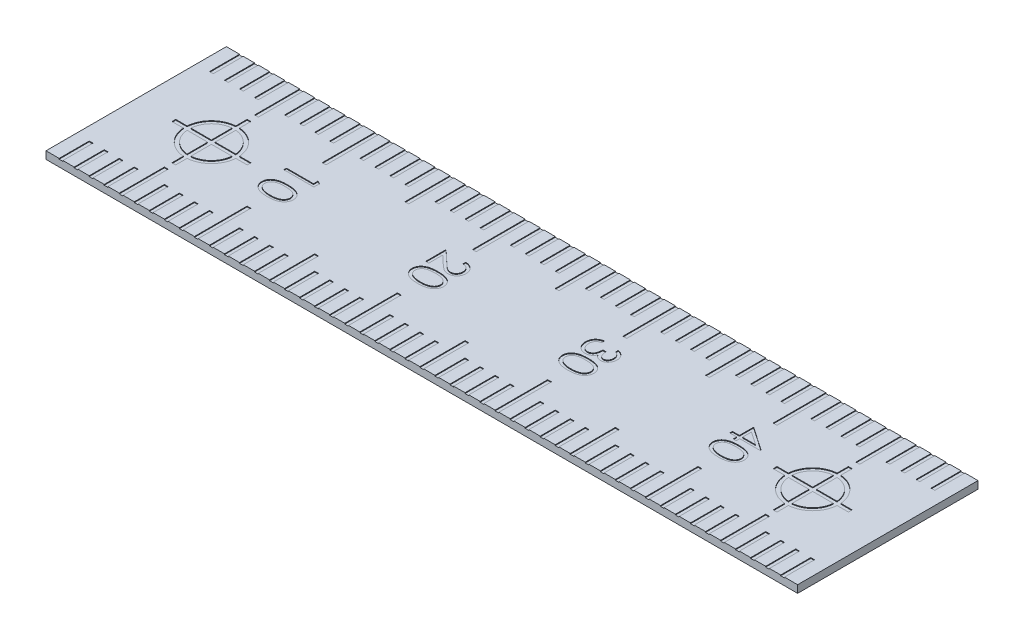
from build123d import *

# Parameters (mm, degrees)
SKETCH1_W                = 50
SKETCH1_H                = 12
BOSS_EXTRUDE1_DEPTH      = 0.5
SKETCH2_W                = 0.25
SKETCH2_H                = 2
CUT_EXTRUDE2_DEPTH       = 0.05
LPATTERN2_COUNT          = 49
LPATTERN2_PITCH          = 1
SKETCH3_W                = 0.25
SKETCH3_H                = 1.5
CUT_EXTRUDE3_DEPTH       = 0.05
LPATTERN3_COUNT          = 4
LPATTERN3_PITCH          = 10
SKETCH4_W                = 0.25
SKETCH4_H                = 1
CUT_EXTRUDE4_DEPTH       = 0.05
LPATTERN4_COUNT          = 4
LPATTERN4_PITCH          = 10
LPATTERN4_COL_COUNT      = 2
LPATTERN4_COL_PITCH      = 10
CUT_EXTRUDE6_DEPTH       = 0.05
LPATTERN5_COUNT          = 2
LPATTERN5_PITCH          = 40
MIRROR1_COPY_1_SKETCH_W  = 0.25
MIRROR1_COPY_1_SKETCH_H  = 2
MIRROR1_COPY_1_DEPTH     = 0.05
MIRROR1_COPY_2_SKETCH_W  = 0.25
MIRROR1_COPY_2_SKETCH_H  = 2
MIRROR1_COPY_2_DEPTH     = 0.05
MIRROR1_COPY_3_SKETCH_W  = 0.25
MIRROR1_COPY_3_SKETCH_H  = 2
MIRROR1_COPY_3_DEPTH     = 0.05
MIRROR1_COPY_4_SKETCH_W  = 0.25
MIRROR1_COPY_4_SKETCH_H  = 2
MIRROR1_COPY_4_DEPTH     = 0.05
MIRROR1_COPY_5_SKETCH_W  = 0.25
MIRROR1_COPY_5_SKETCH_H  = 2
MIRROR1_COPY_5_DEPTH     = 0.05
MIRROR1_COPY_6_SKETCH_W  = 0.25
MIRROR1_COPY_6_SKETCH_H  = 2
MIRROR1_COPY_6_DEPTH     = 0.05
MIRROR1_COPY_7_SKETCH_W  = 0.25
MIRROR1_COPY_7_SKETCH_H  = 2
MIRROR1_COPY_7_DEPTH     = 0.05
MIRROR1_COPY_8_SKETCH_W  = 0.25
MIRROR1_COPY_8_SKETCH_H  = 2
MIRROR1_COPY_8_DEPTH     = 0.05
MIRROR1_COPY_9_SKETCH_W  = 0.25
MIRROR1_COPY_9_SKETCH_H  = 2
MIRROR1_COPY_9_DEPTH     = 0.05
MIRROR1_COPY_10_SKETCH_W = 0.25
MIRROR1_COPY_10_SKETCH_H = 2
MIRROR1_COPY_10_DEPTH    = 0.05
MIRROR1_COPY_11_SKETCH_W = 0.25
MIRROR1_COPY_11_SKETCH_H = 2
MIRROR1_COPY_11_DEPTH    = 0.05
MIRROR1_COPY_12_SKETCH_W = 0.25
MIRROR1_COPY_12_SKETCH_H = 2
MIRROR1_COPY_12_DEPTH    = 0.05
MIRROR1_COPY_13_SKETCH_W = 0.25
MIRROR1_COPY_13_SKETCH_H = 2
MIRROR1_COPY_13_DEPTH    = 0.05
MIRROR1_COPY_14_SKETCH_W = 0.25
MIRROR1_COPY_14_SKETCH_H = 2
MIRROR1_COPY_14_DEPTH    = 0.05
MIRROR1_COPY_15_SKETCH_W = 0.25
MIRROR1_COPY_15_SKETCH_H = 2
MIRROR1_COPY_15_DEPTH    = 0.05
MIRROR1_COPY_16_SKETCH_W = 0.25
MIRROR1_COPY_16_SKETCH_H = 2
MIRROR1_COPY_16_DEPTH    = 0.05
MIRROR1_COPY_17_SKETCH_W = 0.25
MIRROR1_COPY_17_SKETCH_H = 2
MIRROR1_COPY_17_DEPTH    = 0.05
MIRROR1_COPY_18_SKETCH_W = 0.25
MIRROR1_COPY_18_SKETCH_H = 2
MIRROR1_COPY_18_DEPTH    = 0.05
MIRROR1_COPY_19_SKETCH_W = 0.25
MIRROR1_COPY_19_SKETCH_H = 2
MIRROR1_COPY_19_DEPTH    = 0.05
MIRROR1_COPY_20_SKETCH_W = 0.25
MIRROR1_COPY_20_SKETCH_H = 2
MIRROR1_COPY_20_DEPTH    = 0.05
MIRROR1_COPY_21_SKETCH_W = 0.25
MIRROR1_COPY_21_SKETCH_H = 2
MIRROR1_COPY_21_DEPTH    = 0.05
MIRROR1_COPY_22_SKETCH_W = 0.25
MIRROR1_COPY_22_SKETCH_H = 2
MIRROR1_COPY_22_DEPTH    = 0.05
MIRROR1_COPY_23_SKETCH_W = 0.25
MIRROR1_COPY_23_SKETCH_H = 2
MIRROR1_COPY_23_DEPTH    = 0.05
MIRROR1_COPY_24_SKETCH_W = 0.25
MIRROR1_COPY_24_SKETCH_H = 2
MIRROR1_COPY_24_DEPTH    = 0.05
MIRROR1_COPY_25_SKETCH_W = 0.25
MIRROR1_COPY_25_SKETCH_H = 2
MIRROR1_COPY_25_DEPTH    = 0.05
MIRROR1_COPY_26_SKETCH_W = 0.25
MIRROR1_COPY_26_SKETCH_H = 2
MIRROR1_COPY_26_DEPTH    = 0.05
MIRROR1_COPY_27_SKETCH_W = 0.25
MIRROR1_COPY_27_SKETCH_H = 2
MIRROR1_COPY_27_DEPTH    = 0.05
MIRROR1_COPY_28_SKETCH_W = 0.25
MIRROR1_COPY_28_SKETCH_H = 2
MIRROR1_COPY_28_DEPTH    = 0.05
MIRROR1_COPY_29_SKETCH_W = 0.25
MIRROR1_COPY_29_SKETCH_H = 2
MIRROR1_COPY_29_DEPTH    = 0.05
MIRROR1_COPY_30_SKETCH_W = 0.25
MIRROR1_COPY_30_SKETCH_H = 2
MIRROR1_COPY_30_DEPTH    = 0.05
MIRROR1_COPY_31_SKETCH_W = 0.25
MIRROR1_COPY_31_SKETCH_H = 2
MIRROR1_COPY_31_DEPTH    = 0.05
MIRROR1_COPY_32_SKETCH_W = 0.25
MIRROR1_COPY_32_SKETCH_H = 2
MIRROR1_COPY_32_DEPTH    = 0.05
MIRROR1_COPY_33_SKETCH_W = 0.25
MIRROR1_COPY_33_SKETCH_H = 2
MIRROR1_COPY_33_DEPTH    = 0.05
MIRROR1_COPY_34_SKETCH_W = 0.25
MIRROR1_COPY_34_SKETCH_H = 2
MIRROR1_COPY_34_DEPTH    = 0.05
MIRROR1_COPY_35_SKETCH_W = 0.25
MIRROR1_COPY_35_SKETCH_H = 2
MIRROR1_COPY_35_DEPTH    = 0.05
MIRROR1_COPY_36_SKETCH_W = 0.25
MIRROR1_COPY_36_SKETCH_H = 2
MIRROR1_COPY_36_DEPTH    = 0.05
MIRROR1_COPY_37_SKETCH_W = 0.25
MIRROR1_COPY_37_SKETCH_H = 2
MIRROR1_COPY_37_DEPTH    = 0.05
MIRROR1_COPY_38_SKETCH_W = 0.25
MIRROR1_COPY_38_SKETCH_H = 2
MIRROR1_COPY_38_DEPTH    = 0.05
MIRROR1_COPY_39_SKETCH_W = 0.25
MIRROR1_COPY_39_SKETCH_H = 2
MIRROR1_COPY_39_DEPTH    = 0.05
MIRROR1_COPY_40_SKETCH_W = 0.25
MIRROR1_COPY_40_SKETCH_H = 2
MIRROR1_COPY_40_DEPTH    = 0.05
MIRROR1_COPY_41_SKETCH_W = 0.25
MIRROR1_COPY_41_SKETCH_H = 2
MIRROR1_COPY_41_DEPTH    = 0.05
MIRROR1_COPY_42_SKETCH_W = 0.25
MIRROR1_COPY_42_SKETCH_H = 2
MIRROR1_COPY_42_DEPTH    = 0.05
MIRROR1_COPY_43_SKETCH_W = 0.25
MIRROR1_COPY_43_SKETCH_H = 2
MIRROR1_COPY_43_DEPTH    = 0.05
MIRROR1_COPY_44_SKETCH_W = 0.25
MIRROR1_COPY_44_SKETCH_H = 2
MIRROR1_COPY_44_DEPTH    = 0.05
MIRROR1_COPY_45_SKETCH_W = 0.25
MIRROR1_COPY_45_SKETCH_H = 2
MIRROR1_COPY_45_DEPTH    = 0.05
MIRROR1_COPY_46_SKETCH_W = 0.25
MIRROR1_COPY_46_SKETCH_H = 2
MIRROR1_COPY_46_DEPTH    = 0.05
MIRROR1_COPY_47_SKETCH_W = 0.25
MIRROR1_COPY_47_SKETCH_H = 2
MIRROR1_COPY_47_DEPTH    = 0.05
MIRROR1_COPY_48_SKETCH_W = 0.25
MIRROR1_COPY_48_SKETCH_H = 2
MIRROR1_COPY_48_DEPTH    = 0.05
MIRROR1_COPY_49_SKETCH_W = 0.25
MIRROR1_COPY_49_SKETCH_H = 1.5
MIRROR1_COPY_49_DEPTH    = 0.05
MIRROR1_COPY_50_SKETCH_W = 0.25
MIRROR1_COPY_50_SKETCH_H = 1.5
MIRROR1_COPY_50_DEPTH    = 0.05
MIRROR1_COPY_51_SKETCH_W = 0.25
MIRROR1_COPY_51_SKETCH_H = 1.5
MIRROR1_COPY_51_DEPTH    = 0.05
MIRROR1_COPY_52_SKETCH_W = 0.25
MIRROR1_COPY_52_SKETCH_H = 1
MIRROR1_COPY_52_DEPTH    = 0.05
MIRROR1_COPY_53_SKETCH_W = 0.25
MIRROR1_COPY_53_SKETCH_H = 1
MIRROR1_COPY_53_DEPTH    = 0.05
MIRROR1_COPY_54_SKETCH_W = 0.25
MIRROR1_COPY_54_SKETCH_H = 1
MIRROR1_COPY_54_DEPTH    = 0.05
MIRROR1_COPY_55_SKETCH_W = 0.25
MIRROR1_COPY_55_SKETCH_H = 1
MIRROR1_COPY_55_DEPTH    = 0.05
CUT_EXTRUDE16_DEPTH      = 0.05


with BuildPart() as part:
    # Sketch1 → Boss-Extrude1 (new body)
    with BuildSketch(Plane(origin=(0, 0, 0), x_dir=(1, 0, 0), z_dir=(0, 1, 0))):
        Rectangle(SKETCH1_W, SKETCH1_H)
    extrude(amount=-BOSS_EXTRUDE1_DEPTH)

    # Sketch2 → Cut-Extrude2 (cut)
    with BuildSketch(Plane(origin=(0, 0, 0), x_dir=(1, 0, 0), z_dir=(0, 1, 0))):
        with Locations((-24, 5)):
            Rectangle(SKETCH2_W, SKETCH2_H)
    cut_extrude2 = extrude(amount=-CUT_EXTRUDE2_DEPTH, mode=Mode.SUBTRACT)

    # LPattern2: Cut-Extrude2 ×49
    with Locations(*[(i * LPATTERN2_PITCH, 0, 0) for i in range(1, LPATTERN2_COUNT)]):
        add(cut_extrude2, mode=Mode.SUBTRACT)

    # Sketch3 → Cut-Extrude3 (cut)
    with BuildSketch(Plane(origin=(0, 0, 0), x_dir=(1, 0, 0), z_dir=(0, 1, 0))):
        with Locations((-15, 3.25)):
            Rectangle(SKETCH3_W, SKETCH3_H)
    cut_extrude3 = extrude(amount=-CUT_EXTRUDE3_DEPTH, mode=Mode.SUBTRACT)

    # LPattern3: Cut-Extrude3 ×4
    with Locations(*[(i * LPATTERN3_PITCH, 0, 0) for i in range(1, LPATTERN3_COUNT)]):
        add(cut_extrude3, mode=Mode.SUBTRACT)

    # Sketch4 → Cut-Extrude4 (cut)
    with BuildSketch(Plane(origin=(0, 0, 0), x_dir=(1, 0, 0), z_dir=(0, 1, 0))):
        with Locations((-10, 3.5)):
            Rectangle(SKETCH4_W, SKETCH4_H)
    cut_extrude4 = extrude(amount=-CUT_EXTRUDE4_DEPTH, mode=Mode.SUBTRACT)

    # LPattern4: Cut-Extrude4 ×4
    with Locations(*[(i * LPATTERN4_PITCH, 0, 0) for i in range(1, LPATTERN4_COUNT)]):
        add(cut_extrude4, mode=Mode.SUBTRACT)

    # LPattern4 col: Cut-Extrude4 ×2
    with Locations(*[(-i * LPATTERN4_COL_PITCH, 0, 0) for i in range(1, LPATTERN4_COL_COUNT)]):
        add(cut_extrude4, mode=Mode.SUBTRACT)

    # Sketch5 → Cut-Extrude6 (cut)
    with BuildSketch(Plane(origin=(0, 0, 0), x_dir=(1, 0, 0), z_dir=(0, 1, 0))):
        with BuildLine():
            Line((-20.12, 2.5), (-19.87, 2.5))
            Line((-19.87, 2.5), (-19.87, 1.745530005))
            ThreePointArc((-19.87, 1.745530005), (-18.757563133, 1.237436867), (-18.249469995, 0.125))
            Line((-18.249469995, 0.125), (-17.495, 0.125))
            Line((-17.495, 0.125), (-17.495, -0.125))
            Line((-17.495, -0.125), (-18.249469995, -0.125))
            ThreePointArc((-18.249469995, -0.125), (-18.757563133, -1.237436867), (-19.87, -1.745530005))
            Line((-19.87, -1.745530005), (-19.87, -2.5))
            Line((-19.87, -2.5), (-20.12, -2.5))
            Line((-20.12, -2.5), (-20.12, -1.745530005))
            ThreePointArc((-20.12, -1.745530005), (-21.232436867, -1.237436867), (-21.740530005, -0.125))
            Line((-21.740530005, -0.125), (-22.495, -0.125))
            Line((-22.495, -0.125), (-22.495, 0.125))
            Line((-22.495, 0.125), (-21.740530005, 0.125))
            ThreePointArc((-21.740530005, 0.125), (-21.232436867, 1.237436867), (-20.12, 1.745530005))
            Line((-20.12, 1.745530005), (-20.12, 2.5))
        make_face()
        with BuildLine():
            Line((-20.12, 1.494782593), (-20.12, 0.125))
            Line((-20.12, 0.125), (-21.489782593, 0.125))
            ThreePointArc((-21.489782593, 0.125), (-21.055660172, 1.060660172), (-20.12, 1.494782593))
        make_face(mode=Mode.SUBTRACT)
        with BuildLine():
            Line((-19.87, 1.494782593), (-19.87, 0.125))
            Line((-19.87, 0.125), (-18.500217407, 0.125))
            ThreePointArc((-18.500217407, 0.125), (-18.934339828, 1.060660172), (-19.87, 1.494782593))
        make_face(mode=Mode.SUBTRACT)
        with BuildLine():
            Line((-21.489782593, -0.125), (-20.12, -0.125))
            Line((-20.12, -0.125), (-20.12, -1.494782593))
            ThreePointArc((-20.12, -1.494782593), (-21.055660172, -1.060660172), (-21.489782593, -0.125))
        make_face(mode=Mode.SUBTRACT)
        with BuildLine():
            Line((-19.87, -0.125), (-19.87, -1.494782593))
            ThreePointArc((-19.87, -1.494782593), (-18.934339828, -1.060660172), (-18.500217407, -0.125))
            Line((-18.500217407, -0.125), (-19.87, -0.125))
        make_face(mode=Mode.SUBTRACT)
    cut_extrude6 = extrude(amount=-CUT_EXTRUDE6_DEPTH, mode=Mode.SUBTRACT)

    # LPattern5: Cut-Extrude6 ×2
    with Locations(*[(i * LPATTERN5_PITCH, 0, 0) for i in range(1, LPATTERN5_COUNT)]):
        add(cut_extrude6, mode=Mode.SUBTRACT)

    # Mirror1: Cut-Extrude2, Cut-Extrude3, Cut-Extrude4 across plane
    add(cut_extrude2.mirror(Plane.XY), mode=Mode.SUBTRACT)
    add(cut_extrude3.mirror(Plane.XY), mode=Mode.SUBTRACT)
    add(cut_extrude4.mirror(Plane.XY), mode=Mode.SUBTRACT)

    # Mirror1 copy 1 sketch → Mirror1 copy 1 (cut)
    with BuildSketch(Plane(origin=(1, 0, 0), x_dir=(1, 0, 0), z_dir=(0, 1, 0))):
        with Locations((-24, -5)):
            Rectangle(MIRROR1_COPY_1_SKETCH_W, MIRROR1_COPY_1_SKETCH_H)
    extrude(amount=-MIRROR1_COPY_1_DEPTH, mode=Mode.SUBTRACT)

    # Mirror1 copy 2 sketch → Mirror1 copy 2 (cut)
    with BuildSketch(Plane(origin=(2, 0, 0), x_dir=(1, 0, 0), z_dir=(0, 1, 0))):
        with Locations((-24, -5)):
            Rectangle(MIRROR1_COPY_2_SKETCH_W, MIRROR1_COPY_2_SKETCH_H)
    extrude(amount=-MIRROR1_COPY_2_DEPTH, mode=Mode.SUBTRACT)

    # Mirror1 copy 3 sketch → Mirror1 copy 3 (cut)
    with BuildSketch(Plane(origin=(3, 0, 0), x_dir=(1, 0, 0), z_dir=(0, 1, 0))):
        with Locations((-24, -5)):
            Rectangle(MIRROR1_COPY_3_SKETCH_W, MIRROR1_COPY_3_SKETCH_H)
    extrude(amount=-MIRROR1_COPY_3_DEPTH, mode=Mode.SUBTRACT)

    # Mirror1 copy 4 sketch → Mirror1 copy 4 (cut)
    with BuildSketch(Plane(origin=(4, 0, 0), x_dir=(1, 0, 0), z_dir=(0, 1, 0))):
        with Locations((-24, -5)):
            Rectangle(MIRROR1_COPY_4_SKETCH_W, MIRROR1_COPY_4_SKETCH_H)
    extrude(amount=-MIRROR1_COPY_4_DEPTH, mode=Mode.SUBTRACT)

    # Mirror1 copy 5 sketch → Mirror1 copy 5 (cut)
    with BuildSketch(Plane(origin=(5, 0, 0), x_dir=(1, 0, 0), z_dir=(0, 1, 0))):
        with Locations((-24, -5)):
            Rectangle(MIRROR1_COPY_5_SKETCH_W, MIRROR1_COPY_5_SKETCH_H)
    extrude(amount=-MIRROR1_COPY_5_DEPTH, mode=Mode.SUBTRACT)

    # Mirror1 copy 6 sketch → Mirror1 copy 6 (cut)
    with BuildSketch(Plane(origin=(6, 0, 0), x_dir=(1, 0, 0), z_dir=(0, 1, 0))):
        with Locations((-24, -5)):
            Rectangle(MIRROR1_COPY_6_SKETCH_W, MIRROR1_COPY_6_SKETCH_H)
    extrude(amount=-MIRROR1_COPY_6_DEPTH, mode=Mode.SUBTRACT)

    # Mirror1 copy 7 sketch → Mirror1 copy 7 (cut)
    with BuildSketch(Plane(origin=(7, 0, 0), x_dir=(1, 0, 0), z_dir=(0, 1, 0))):
        with Locations((-24, -5)):
            Rectangle(MIRROR1_COPY_7_SKETCH_W, MIRROR1_COPY_7_SKETCH_H)
    extrude(amount=-MIRROR1_COPY_7_DEPTH, mode=Mode.SUBTRACT)

    # Mirror1 copy 8 sketch → Mirror1 copy 8 (cut)
    with BuildSketch(Plane(origin=(8, 0, 0), x_dir=(1, 0, 0), z_dir=(0, 1, 0))):
        with Locations((-24, -5)):
            Rectangle(MIRROR1_COPY_8_SKETCH_W, MIRROR1_COPY_8_SKETCH_H)
    extrude(amount=-MIRROR1_COPY_8_DEPTH, mode=Mode.SUBTRACT)

    # Mirror1 copy 9 sketch → Mirror1 copy 9 (cut)
    with BuildSketch(Plane(origin=(9, 0, 0), x_dir=(1, 0, 0), z_dir=(0, 1, 0))):
        with Locations((-24, -5)):
            Rectangle(MIRROR1_COPY_9_SKETCH_W, MIRROR1_COPY_9_SKETCH_H)
    extrude(amount=-MIRROR1_COPY_9_DEPTH, mode=Mode.SUBTRACT)

    # Mirror1 copy 10 sketch → Mirror1 copy 10 (cut)
    with BuildSketch(Plane(origin=(10, 0, 0), x_dir=(1, 0, 0), z_dir=(0, 1, 0))):
        with Locations((-24, -5)):
            Rectangle(MIRROR1_COPY_10_SKETCH_W, MIRROR1_COPY_10_SKETCH_H)
    extrude(amount=-MIRROR1_COPY_10_DEPTH, mode=Mode.SUBTRACT)

    # Mirror1 copy 11 sketch → Mirror1 copy 11 (cut)
    with BuildSketch(Plane(origin=(11, 0, 0), x_dir=(1, 0, 0), z_dir=(0, 1, 0))):
        with Locations((-24, -5)):
            Rectangle(MIRROR1_COPY_11_SKETCH_W, MIRROR1_COPY_11_SKETCH_H)
    extrude(amount=-MIRROR1_COPY_11_DEPTH, mode=Mode.SUBTRACT)

    # Mirror1 copy 12 sketch → Mirror1 copy 12 (cut)
    with BuildSketch(Plane(origin=(12, 0, 0), x_dir=(1, 0, 0), z_dir=(0, 1, 0))):
        with Locations((-24, -5)):
            Rectangle(MIRROR1_COPY_12_SKETCH_W, MIRROR1_COPY_12_SKETCH_H)
    extrude(amount=-MIRROR1_COPY_12_DEPTH, mode=Mode.SUBTRACT)

    # Mirror1 copy 13 sketch → Mirror1 copy 13 (cut)
    with BuildSketch(Plane(origin=(13, 0, 0), x_dir=(1, 0, 0), z_dir=(0, 1, 0))):
        with Locations((-24, -5)):
            Rectangle(MIRROR1_COPY_13_SKETCH_W, MIRROR1_COPY_13_SKETCH_H)
    extrude(amount=-MIRROR1_COPY_13_DEPTH, mode=Mode.SUBTRACT)

    # Mirror1 copy 14 sketch → Mirror1 copy 14 (cut)
    with BuildSketch(Plane(origin=(14, 0, 0), x_dir=(1, 0, 0), z_dir=(0, 1, 0))):
        with Locations((-24, -5)):
            Rectangle(MIRROR1_COPY_14_SKETCH_W, MIRROR1_COPY_14_SKETCH_H)
    extrude(amount=-MIRROR1_COPY_14_DEPTH, mode=Mode.SUBTRACT)

    # Mirror1 copy 15 sketch → Mirror1 copy 15 (cut)
    with BuildSketch(Plane(origin=(15, 0, 0), x_dir=(1, 0, 0), z_dir=(0, 1, 0))):
        with Locations((-24, -5)):
            Rectangle(MIRROR1_COPY_15_SKETCH_W, MIRROR1_COPY_15_SKETCH_H)
    extrude(amount=-MIRROR1_COPY_15_DEPTH, mode=Mode.SUBTRACT)

    # Mirror1 copy 16 sketch → Mirror1 copy 16 (cut)
    with BuildSketch(Plane(origin=(16, 0, 0), x_dir=(1, 0, 0), z_dir=(0, 1, 0))):
        with Locations((-24, -5)):
            Rectangle(MIRROR1_COPY_16_SKETCH_W, MIRROR1_COPY_16_SKETCH_H)
    extrude(amount=-MIRROR1_COPY_16_DEPTH, mode=Mode.SUBTRACT)

    # Mirror1 copy 17 sketch → Mirror1 copy 17 (cut)
    with BuildSketch(Plane(origin=(17, 0, 0), x_dir=(1, 0, 0), z_dir=(0, 1, 0))):
        with Locations((-24, -5)):
            Rectangle(MIRROR1_COPY_17_SKETCH_W, MIRROR1_COPY_17_SKETCH_H)
    extrude(amount=-MIRROR1_COPY_17_DEPTH, mode=Mode.SUBTRACT)

    # Mirror1 copy 18 sketch → Mirror1 copy 18 (cut)
    with BuildSketch(Plane(origin=(18, 0, 0), x_dir=(1, 0, 0), z_dir=(0, 1, 0))):
        with Locations((-24, -5)):
            Rectangle(MIRROR1_COPY_18_SKETCH_W, MIRROR1_COPY_18_SKETCH_H)
    extrude(amount=-MIRROR1_COPY_18_DEPTH, mode=Mode.SUBTRACT)

    # Mirror1 copy 19 sketch → Mirror1 copy 19 (cut)
    with BuildSketch(Plane(origin=(19, 0, 0), x_dir=(1, 0, 0), z_dir=(0, 1, 0))):
        with Locations((-24, -5)):
            Rectangle(MIRROR1_COPY_19_SKETCH_W, MIRROR1_COPY_19_SKETCH_H)
    extrude(amount=-MIRROR1_COPY_19_DEPTH, mode=Mode.SUBTRACT)

    # Mirror1 copy 20 sketch → Mirror1 copy 20 (cut)
    with BuildSketch(Plane(origin=(20, 0, 0), x_dir=(1, 0, 0), z_dir=(0, 1, 0))):
        with Locations((-24, -5)):
            Rectangle(MIRROR1_COPY_20_SKETCH_W, MIRROR1_COPY_20_SKETCH_H)
    extrude(amount=-MIRROR1_COPY_20_DEPTH, mode=Mode.SUBTRACT)

    # Mirror1 copy 21 sketch → Mirror1 copy 21 (cut)
    with BuildSketch(Plane(origin=(21, 0, 0), x_dir=(1, 0, 0), z_dir=(0, 1, 0))):
        with Locations((-24, -5)):
            Rectangle(MIRROR1_COPY_21_SKETCH_W, MIRROR1_COPY_21_SKETCH_H)
    extrude(amount=-MIRROR1_COPY_21_DEPTH, mode=Mode.SUBTRACT)

    # Mirror1 copy 22 sketch → Mirror1 copy 22 (cut)
    with BuildSketch(Plane(origin=(22, 0, 0), x_dir=(1, 0, 0), z_dir=(0, 1, 0))):
        with Locations((-24, -5)):
            Rectangle(MIRROR1_COPY_22_SKETCH_W, MIRROR1_COPY_22_SKETCH_H)
    extrude(amount=-MIRROR1_COPY_22_DEPTH, mode=Mode.SUBTRACT)

    # Mirror1 copy 23 sketch → Mirror1 copy 23 (cut)
    with BuildSketch(Plane(origin=(23, 0, 0), x_dir=(1, 0, 0), z_dir=(0, 1, 0))):
        with Locations((-24, -5)):
            Rectangle(MIRROR1_COPY_23_SKETCH_W, MIRROR1_COPY_23_SKETCH_H)
    extrude(amount=-MIRROR1_COPY_23_DEPTH, mode=Mode.SUBTRACT)

    # Mirror1 copy 24 sketch → Mirror1 copy 24 (cut)
    with BuildSketch(Plane(origin=(24, 0, 0), x_dir=(1, 0, 0), z_dir=(0, 1, 0))):
        with Locations((-24, -5)):
            Rectangle(MIRROR1_COPY_24_SKETCH_W, MIRROR1_COPY_24_SKETCH_H)
    extrude(amount=-MIRROR1_COPY_24_DEPTH, mode=Mode.SUBTRACT)

    # Mirror1 copy 25 sketch → Mirror1 copy 25 (cut)
    with BuildSketch(Plane(origin=(25, 0, 0), x_dir=(1, 0, 0), z_dir=(0, 1, 0))):
        with Locations((-24, -5)):
            Rectangle(MIRROR1_COPY_25_SKETCH_W, MIRROR1_COPY_25_SKETCH_H)
    extrude(amount=-MIRROR1_COPY_25_DEPTH, mode=Mode.SUBTRACT)

    # Mirror1 copy 26 sketch → Mirror1 copy 26 (cut)
    with BuildSketch(Plane(origin=(26, 0, 0), x_dir=(1, 0, 0), z_dir=(0, 1, 0))):
        with Locations((-24, -5)):
            Rectangle(MIRROR1_COPY_26_SKETCH_W, MIRROR1_COPY_26_SKETCH_H)
    extrude(amount=-MIRROR1_COPY_26_DEPTH, mode=Mode.SUBTRACT)

    # Mirror1 copy 27 sketch → Mirror1 copy 27 (cut)
    with BuildSketch(Plane(origin=(27, 0, 0), x_dir=(1, 0, 0), z_dir=(0, 1, 0))):
        with Locations((-24, -5)):
            Rectangle(MIRROR1_COPY_27_SKETCH_W, MIRROR1_COPY_27_SKETCH_H)
    extrude(amount=-MIRROR1_COPY_27_DEPTH, mode=Mode.SUBTRACT)

    # Mirror1 copy 28 sketch → Mirror1 copy 28 (cut)
    with BuildSketch(Plane(origin=(28, 0, 0), x_dir=(1, 0, 0), z_dir=(0, 1, 0))):
        with Locations((-24, -5)):
            Rectangle(MIRROR1_COPY_28_SKETCH_W, MIRROR1_COPY_28_SKETCH_H)
    extrude(amount=-MIRROR1_COPY_28_DEPTH, mode=Mode.SUBTRACT)

    # Mirror1 copy 29 sketch → Mirror1 copy 29 (cut)
    with BuildSketch(Plane(origin=(29, 0, 0), x_dir=(1, 0, 0), z_dir=(0, 1, 0))):
        with Locations((-24, -5)):
            Rectangle(MIRROR1_COPY_29_SKETCH_W, MIRROR1_COPY_29_SKETCH_H)
    extrude(amount=-MIRROR1_COPY_29_DEPTH, mode=Mode.SUBTRACT)

    # Mirror1 copy 30 sketch → Mirror1 copy 30 (cut)
    with BuildSketch(Plane(origin=(30, 0, 0), x_dir=(1, 0, 0), z_dir=(0, 1, 0))):
        with Locations((-24, -5)):
            Rectangle(MIRROR1_COPY_30_SKETCH_W, MIRROR1_COPY_30_SKETCH_H)
    extrude(amount=-MIRROR1_COPY_30_DEPTH, mode=Mode.SUBTRACT)

    # Mirror1 copy 31 sketch → Mirror1 copy 31 (cut)
    with BuildSketch(Plane(origin=(31, 0, 0), x_dir=(1, 0, 0), z_dir=(0, 1, 0))):
        with Locations((-24, -5)):
            Rectangle(MIRROR1_COPY_31_SKETCH_W, MIRROR1_COPY_31_SKETCH_H)
    extrude(amount=-MIRROR1_COPY_31_DEPTH, mode=Mode.SUBTRACT)

    # Mirror1 copy 32 sketch → Mirror1 copy 32 (cut)
    with BuildSketch(Plane(origin=(32, 0, 0), x_dir=(1, 0, 0), z_dir=(0, 1, 0))):
        with Locations((-24, -5)):
            Rectangle(MIRROR1_COPY_32_SKETCH_W, MIRROR1_COPY_32_SKETCH_H)
    extrude(amount=-MIRROR1_COPY_32_DEPTH, mode=Mode.SUBTRACT)

    # Mirror1 copy 33 sketch → Mirror1 copy 33 (cut)
    with BuildSketch(Plane(origin=(33, 0, 0), x_dir=(1, 0, 0), z_dir=(0, 1, 0))):
        with Locations((-24, -5)):
            Rectangle(MIRROR1_COPY_33_SKETCH_W, MIRROR1_COPY_33_SKETCH_H)
    extrude(amount=-MIRROR1_COPY_33_DEPTH, mode=Mode.SUBTRACT)

    # Mirror1 copy 34 sketch → Mirror1 copy 34 (cut)
    with BuildSketch(Plane(origin=(34, 0, 0), x_dir=(1, 0, 0), z_dir=(0, 1, 0))):
        with Locations((-24, -5)):
            Rectangle(MIRROR1_COPY_34_SKETCH_W, MIRROR1_COPY_34_SKETCH_H)
    extrude(amount=-MIRROR1_COPY_34_DEPTH, mode=Mode.SUBTRACT)

    # Mirror1 copy 35 sketch → Mirror1 copy 35 (cut)
    with BuildSketch(Plane(origin=(35, 0, 0), x_dir=(1, 0, 0), z_dir=(0, 1, 0))):
        with Locations((-24, -5)):
            Rectangle(MIRROR1_COPY_35_SKETCH_W, MIRROR1_COPY_35_SKETCH_H)
    extrude(amount=-MIRROR1_COPY_35_DEPTH, mode=Mode.SUBTRACT)

    # Mirror1 copy 36 sketch → Mirror1 copy 36 (cut)
    with BuildSketch(Plane(origin=(36, 0, 0), x_dir=(1, 0, 0), z_dir=(0, 1, 0))):
        with Locations((-24, -5)):
            Rectangle(MIRROR1_COPY_36_SKETCH_W, MIRROR1_COPY_36_SKETCH_H)
    extrude(amount=-MIRROR1_COPY_36_DEPTH, mode=Mode.SUBTRACT)

    # Mirror1 copy 37 sketch → Mirror1 copy 37 (cut)
    with BuildSketch(Plane(origin=(37, 0, 0), x_dir=(1, 0, 0), z_dir=(0, 1, 0))):
        with Locations((-24, -5)):
            Rectangle(MIRROR1_COPY_37_SKETCH_W, MIRROR1_COPY_37_SKETCH_H)
    extrude(amount=-MIRROR1_COPY_37_DEPTH, mode=Mode.SUBTRACT)

    # Mirror1 copy 38 sketch → Mirror1 copy 38 (cut)
    with BuildSketch(Plane(origin=(38, 0, 0), x_dir=(1, 0, 0), z_dir=(0, 1, 0))):
        with Locations((-24, -5)):
            Rectangle(MIRROR1_COPY_38_SKETCH_W, MIRROR1_COPY_38_SKETCH_H)
    extrude(amount=-MIRROR1_COPY_38_DEPTH, mode=Mode.SUBTRACT)

    # Mirror1 copy 39 sketch → Mirror1 copy 39 (cut)
    with BuildSketch(Plane(origin=(39, 0, 0), x_dir=(1, 0, 0), z_dir=(0, 1, 0))):
        with Locations((-24, -5)):
            Rectangle(MIRROR1_COPY_39_SKETCH_W, MIRROR1_COPY_39_SKETCH_H)
    extrude(amount=-MIRROR1_COPY_39_DEPTH, mode=Mode.SUBTRACT)

    # Mirror1 copy 40 sketch → Mirror1 copy 40 (cut)
    with BuildSketch(Plane(origin=(40, 0, 0), x_dir=(1, 0, 0), z_dir=(0, 1, 0))):
        with Locations((-24, -5)):
            Rectangle(MIRROR1_COPY_40_SKETCH_W, MIRROR1_COPY_40_SKETCH_H)
    extrude(amount=-MIRROR1_COPY_40_DEPTH, mode=Mode.SUBTRACT)

    # Mirror1 copy 41 sketch → Mirror1 copy 41 (cut)
    with BuildSketch(Plane(origin=(41, 0, 0), x_dir=(1, 0, 0), z_dir=(0, 1, 0))):
        with Locations((-24, -5)):
            Rectangle(MIRROR1_COPY_41_SKETCH_W, MIRROR1_COPY_41_SKETCH_H)
    extrude(amount=-MIRROR1_COPY_41_DEPTH, mode=Mode.SUBTRACT)

    # Mirror1 copy 42 sketch → Mirror1 copy 42 (cut)
    with BuildSketch(Plane(origin=(42, 0, 0), x_dir=(1, 0, 0), z_dir=(0, 1, 0))):
        with Locations((-24, -5)):
            Rectangle(MIRROR1_COPY_42_SKETCH_W, MIRROR1_COPY_42_SKETCH_H)
    extrude(amount=-MIRROR1_COPY_42_DEPTH, mode=Mode.SUBTRACT)

    # Mirror1 copy 43 sketch → Mirror1 copy 43 (cut)
    with BuildSketch(Plane(origin=(43, 0, 0), x_dir=(1, 0, 0), z_dir=(0, 1, 0))):
        with Locations((-24, -5)):
            Rectangle(MIRROR1_COPY_43_SKETCH_W, MIRROR1_COPY_43_SKETCH_H)
    extrude(amount=-MIRROR1_COPY_43_DEPTH, mode=Mode.SUBTRACT)

    # Mirror1 copy 44 sketch → Mirror1 copy 44 (cut)
    with BuildSketch(Plane(origin=(44, 0, 0), x_dir=(1, 0, 0), z_dir=(0, 1, 0))):
        with Locations((-24, -5)):
            Rectangle(MIRROR1_COPY_44_SKETCH_W, MIRROR1_COPY_44_SKETCH_H)
    extrude(amount=-MIRROR1_COPY_44_DEPTH, mode=Mode.SUBTRACT)

    # Mirror1 copy 45 sketch → Mirror1 copy 45 (cut)
    with BuildSketch(Plane(origin=(45, 0, 0), x_dir=(1, 0, 0), z_dir=(0, 1, 0))):
        with Locations((-24, -5)):
            Rectangle(MIRROR1_COPY_45_SKETCH_W, MIRROR1_COPY_45_SKETCH_H)
    extrude(amount=-MIRROR1_COPY_45_DEPTH, mode=Mode.SUBTRACT)

    # Mirror1 copy 46 sketch → Mirror1 copy 46 (cut)
    with BuildSketch(Plane(origin=(46, 0, 0), x_dir=(1, 0, 0), z_dir=(0, 1, 0))):
        with Locations((-24, -5)):
            Rectangle(MIRROR1_COPY_46_SKETCH_W, MIRROR1_COPY_46_SKETCH_H)
    extrude(amount=-MIRROR1_COPY_46_DEPTH, mode=Mode.SUBTRACT)

    # Mirror1 copy 47 sketch → Mirror1 copy 47 (cut)
    with BuildSketch(Plane(origin=(47, 0, 0), x_dir=(1, 0, 0), z_dir=(0, 1, 0))):
        with Locations((-24, -5)):
            Rectangle(MIRROR1_COPY_47_SKETCH_W, MIRROR1_COPY_47_SKETCH_H)
    extrude(amount=-MIRROR1_COPY_47_DEPTH, mode=Mode.SUBTRACT)

    # Mirror1 copy 48 sketch → Mirror1 copy 48 (cut)
    with BuildSketch(Plane(origin=(48, 0, 0), x_dir=(1, 0, 0), z_dir=(0, 1, 0))):
        with Locations((-24, -5)):
            Rectangle(MIRROR1_COPY_48_SKETCH_W, MIRROR1_COPY_48_SKETCH_H)
    extrude(amount=-MIRROR1_COPY_48_DEPTH, mode=Mode.SUBTRACT)

    # Mirror1 copy 49 sketch → Mirror1 copy 49 (cut)
    with BuildSketch(Plane(origin=(10, 0, 0), x_dir=(1, 0, 0), z_dir=(0, 1, 0))):
        with Locations((-15, -3.25)):
            Rectangle(MIRROR1_COPY_49_SKETCH_W, MIRROR1_COPY_49_SKETCH_H)
    extrude(amount=-MIRROR1_COPY_49_DEPTH, mode=Mode.SUBTRACT)

    # Mirror1 copy 50 sketch → Mirror1 copy 50 (cut)
    with BuildSketch(Plane(origin=(20, 0, 0), x_dir=(1, 0, 0), z_dir=(0, 1, 0))):
        with Locations((-15, -3.25)):
            Rectangle(MIRROR1_COPY_50_SKETCH_W, MIRROR1_COPY_50_SKETCH_H)
    extrude(amount=-MIRROR1_COPY_50_DEPTH, mode=Mode.SUBTRACT)

    # Mirror1 copy 51 sketch → Mirror1 copy 51 (cut)
    with BuildSketch(Plane(origin=(30, 0, 0), x_dir=(1, 0, 0), z_dir=(0, 1, 0))):
        with Locations((-15, -3.25)):
            Rectangle(MIRROR1_COPY_51_SKETCH_W, MIRROR1_COPY_51_SKETCH_H)
    extrude(amount=-MIRROR1_COPY_51_DEPTH, mode=Mode.SUBTRACT)

    # Mirror1 copy 52 sketch → Mirror1 copy 52 (cut)
    with BuildSketch(Plane(origin=(10, 0, 0), x_dir=(1, 0, 0), z_dir=(0, 1, 0))):
        with Locations((-10, -3.5)):
            Rectangle(MIRROR1_COPY_52_SKETCH_W, MIRROR1_COPY_52_SKETCH_H)
    extrude(amount=-MIRROR1_COPY_52_DEPTH, mode=Mode.SUBTRACT)

    # Mirror1 copy 53 sketch → Mirror1 copy 53 (cut)
    with BuildSketch(Plane(origin=(20, 0, 0), x_dir=(1, 0, 0), z_dir=(0, 1, 0))):
        with Locations((-10, -3.5)):
            Rectangle(MIRROR1_COPY_53_SKETCH_W, MIRROR1_COPY_53_SKETCH_H)
    extrude(amount=-MIRROR1_COPY_53_DEPTH, mode=Mode.SUBTRACT)

    # Mirror1 copy 54 sketch → Mirror1 copy 54 (cut)
    with BuildSketch(Plane(origin=(30, 0, 0), x_dir=(1, 0, 0), z_dir=(0, 1, 0))):
        with Locations((-10, -3.5)):
            Rectangle(MIRROR1_COPY_54_SKETCH_W, MIRROR1_COPY_54_SKETCH_H)
    extrude(amount=-MIRROR1_COPY_54_DEPTH, mode=Mode.SUBTRACT)

    # Mirror1 copy 55 sketch → Mirror1 copy 55 (cut)
    with BuildSketch(Plane(origin=(-10, 0, 0), x_dir=(1, 0, 0), z_dir=(0, 1, 0))):
        with Locations((-10, -3.5)):
            Rectangle(MIRROR1_COPY_55_SKETCH_W, MIRROR1_COPY_55_SKETCH_H)
    extrude(amount=-MIRROR1_COPY_55_DEPTH, mode=Mode.SUBTRACT)

    # Sketch24 → Cut-Extrude16 (cut)
    # profile 1 of 8: a face of its own
    with BuildSketch(Plane(origin=(0, 0, 0), x_dir=(1, 0, 0), z_dir=(0, 1, 0))):
        Polygon((-14, 1.190304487), (-14, 0.820512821), (-16, 0.820512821), (-16, 1), (-14.205128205, 1), (-14.205128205, 1.307692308), align=None)
    # profile 2 of 8: a face of its own
    with BuildSketch(Plane(origin=(0, 0, 0), x_dir=(1, 0, 0), z_dir=(0, 1, 0))):
        with BuildLine():
            add(Edge.make_bspline(
                [(-15.000801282, 0.076923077), (-14.968745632, 0.076735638), (-14.906477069, 0.076371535), (-14.815742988, 0.072321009), (-14.730622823, 0.065592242), (-14.651112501, 0.056370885), (-14.577191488, 0.045149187), (-14.509057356, 0.030168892), (-14.446394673, 0.01313306), (-14.388999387, -0.00661138), (-14.336097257, -0.028889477), (-14.286713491, -0.053139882), (-14.240910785, -0.080311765), (-14.19800106, -0.1088986), (-14.158463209, -0.139945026), (-14.122372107, -0.17312358), (-14.089705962, -0.20876338), (-14.060075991, -0.246159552), (-14.034264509, -0.285548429), (-14.011006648, -0.325715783), (-13.991917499, -0.3673704), (-13.976232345, -0.410132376), (-13.963664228, -0.453877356), (-13.954960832, -0.49878609), (-13.949506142, -0.544869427), (-13.948983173, -0.575972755), (-13.948717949, -0.591746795)],
                knots=[0, 0, 0, 0, 1.646377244, 3.198111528, 4.663803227, 6.031090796, 7.308794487, 8.502186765, 9.612154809, 10.642545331, 11.617106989, 12.558866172, 13.465886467, 14.35053239, 15.20542558, 16.045215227, 16.865619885, 17.686225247, 18.492864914, 19.282407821, 20.068097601, 20.842842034, 21.620163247, 22.403093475, 23.190129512, 24, 24, 24, 24], degree=3))
            add(Edge.make_bspline(
                [(-13.948717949, -0.591746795), (-13.9489967, -0.607652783), (-13.949551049, -0.639284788), (-13.954879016, -0.686050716), (-13.963719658, -0.731736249), (-13.976245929, -0.776146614), (-13.991786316, -0.819646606), (-14.011264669, -0.861895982), (-14.033938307, -0.903157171), (-14.060580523, -0.942774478), (-14.090284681, -0.98118283), (-14.123863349, -1.017438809), (-14.160977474, -1.051545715), (-14.201229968, -1.083931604), (-14.245392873, -1.11367766), (-14.292698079, -1.142005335), (-14.343972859, -1.167360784), (-14.398361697, -1.191780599), (-14.457369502, -1.212858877), (-14.520663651, -1.23186816), (-14.588991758, -1.24722757), (-14.661995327, -1.26002144), (-14.73994246, -1.269932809), (-14.822666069, -1.277151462), (-14.910220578, -1.280964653), (-14.970082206, -1.281682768), (-15.000801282, -1.282051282)],
                knots=[0, 0, 0, 0, 0.810914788, 1.612654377, 2.396697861, 3.181598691, 3.963628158, 4.749916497, 5.551656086, 6.361998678, 7.18212741, 8.025565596, 8.878627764, 9.750805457, 10.657531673, 11.591944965, 12.560506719, 13.57287815, 14.630710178, 15.753379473, 16.941251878, 18.199788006, 19.531962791, 20.947069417, 22.433333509, 24, 24, 24, 24], degree=3))
            add(Edge.make_bspline(
                [(-15.000801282, -1.282051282), (-15.031386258, -1.281678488), (-15.090979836, -1.280952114), (-15.178141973, -1.27719921), (-15.260421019, -1.269771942), (-15.338046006, -1.260585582), (-15.41055605, -1.24749974), (-15.478640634, -1.232623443), (-15.541712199, -1.214133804), (-15.600408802, -1.193342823), (-15.654531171, -1.169452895), (-15.705362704, -1.14387335), (-15.752629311, -1.115719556), (-15.796791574, -1.085796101), (-15.837393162, -1.053685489), (-15.874534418, -1.01943416), (-15.908190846, -0.983016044), (-15.938300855, -0.944520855), (-15.964632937, -0.904280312), (-15.988169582, -0.863156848), (-16.007268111, -0.820329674), (-16.023393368, -0.77675059), (-16.035948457, -0.7320084), (-16.044544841, -0.686146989), (-16.050590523, -0.639316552), (-16.051050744, -0.607658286), (-16.051282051, -0.591746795)],
                knots=[0, 0, 0, 0, 1.56130642, 3.042141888, 4.451772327, 5.777565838, 7.030558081, 8.211376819, 9.333164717, 10.383253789, 11.387583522, 12.350962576, 13.286244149, 14.193812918, 15.072134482, 15.925989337, 16.770211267, 17.600669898, 18.417446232, 19.22325363, 20.01647746, 20.807971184, 21.593601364, 22.38506573, 23.188331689, 24, 24, 24, 24], degree=3))
            add(Edge.make_bspline(
                [(-16.051282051, -0.591746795), (-16.051014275, -0.575973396), (-16.050486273, -0.544871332), (-16.045068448, -0.498778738), (-16.0362338, -0.453940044), (-16.024236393, -0.410265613), (-16.008988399, -0.367666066), (-15.989593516, -0.326558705), (-15.967098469, -0.286400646), (-15.941506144, -0.24737513), (-15.912178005, -0.21022596), (-15.879741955, -0.174740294), (-15.843384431, -0.141814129), (-15.803687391, -0.111156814), (-15.760987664, -0.082064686), (-15.714864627, -0.055159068), (-15.665018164, -0.030955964), (-15.611823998, -0.008178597), (-15.554006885, 0.011899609), (-15.491009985, 0.029501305), (-15.422484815, 0.04417478), (-15.348634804, 0.055975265), (-15.269404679, 0.065703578), (-15.184654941, 0.072289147), (-15.094458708, 0.076374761), (-15.03259012, 0.07673697), (-15.000801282, 0.076923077)],
                knots=[0, 0, 0, 0, 0.810940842, 1.599017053, 2.38298203, 3.159479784, 3.926441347, 4.70693857, 5.494146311, 6.292334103, 7.104379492, 7.925868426, 8.762126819, 9.623561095, 10.503686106, 11.41783325, 12.366995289, 13.351843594, 14.392337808, 15.512229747, 16.713911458, 17.994391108, 19.357476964, 20.818259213, 22.365182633, 24, 24, 24, 24], degree=3))
        make_face()
        with BuildLine():
            add(Edge.make_bspline(
                [(-15, -0.102564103), (-15.026713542, -0.102632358), (-15.078559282, -0.102764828), (-15.153898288, -0.106225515), (-15.224167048, -0.110939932), (-15.289454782, -0.117020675), (-15.349540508, -0.126050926), (-15.404837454, -0.136169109), (-15.45505307, -0.148482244), (-15.500531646, -0.163051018), (-15.542045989, -0.179644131), (-15.580673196, -0.197764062), (-15.616881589, -0.217219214), (-15.650303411, -0.239030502), (-15.681271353, -0.2627032), (-15.70969642, -0.288276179), (-15.735454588, -0.315704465), (-15.766019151, -0.353674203), (-15.797977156, -0.403554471), (-15.82546348, -0.466724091), (-15.842848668, -0.531662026), (-15.845053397, -0.575750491), (-15.846153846, -0.59775641)],
                knots=[0, 0, 0, 0, 1.459116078, 2.831857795, 4.118796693, 5.306371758, 6.412361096, 7.436813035, 8.376339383, 9.234574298, 10.043323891, 10.816788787, 11.564361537, 12.286735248, 12.994408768, 13.691741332, 14.372975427, 15.047457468, 16.352811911, 17.594285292, 18.799233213, 20, 20, 20, 20], degree=3))
            add(Edge.make_bspline(
                [(-15.846153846, -0.59775641), (-15.845240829, -0.619903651), (-15.843416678, -0.664152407), (-15.8258174, -0.72880029), (-15.799263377, -0.791560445), (-15.767864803, -0.84074441), (-15.7379629, -0.878163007), (-15.712468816, -0.904972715), (-15.683922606, -0.9295796), (-15.653123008, -0.952917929), (-15.619481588, -0.974323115), (-15.583160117, -0.993787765), (-15.544057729, -1.011549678), (-15.516760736, -1.021669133), (-15.502804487, -1.026842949)],
                knots=[0, 0, 0, 0, 1.353760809, 2.704726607, 4.075137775, 5.516104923, 6.260822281, 7.007110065, 7.778089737, 8.566572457, 9.372053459, 10.217411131, 11.088608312, 12, 12, 12, 12], degree=3))
            add(Edge.make_bspline(
                [(-15.502804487, -1.026842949), (-15.484958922, -1.03287253), (-15.448724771, -1.045115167), (-15.39251697, -1.060893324), (-15.333543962, -1.073319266), (-15.272158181, -1.084498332), (-15.207906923, -1.09212865), (-15.140988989, -1.098270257), (-15.071353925, -1.101887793), (-15.024042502, -1.102336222), (-15, -1.102564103)],
                knots=[0, 0, 0, 0, 0.884706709, 1.796334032, 2.740027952, 3.714592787, 4.726048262, 5.777819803, 6.87074269, 8, 8, 8, 8], degree=3))
            add(Edge.make_bspline(
                [(-15, -1.102564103), (-14.975958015, -1.102312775), (-14.928920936, -1.101821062), (-14.860105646, -1.098590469), (-14.794631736, -1.093399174), (-14.732439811, -1.086372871), (-14.673640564, -1.076727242), (-14.618149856, -1.065143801), (-14.565982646, -1.051563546), (-14.517004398, -1.035986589), (-14.471391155, -1.018431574), (-14.429043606, -0.999038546), (-14.38973725, -0.978343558), (-14.353584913, -0.955861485), (-14.320423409, -0.931864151), (-14.290917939, -0.90571693), (-14.264153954, -0.878457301), (-14.233603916, -0.840276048), (-14.202454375, -0.790290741), (-14.173788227, -0.728093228), (-14.157326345, -0.663367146), (-14.155005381, -0.619610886), (-14.153846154, -0.59775641)],
                knots=[0, 0, 0, 0, 1.313668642, 2.570134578, 3.763346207, 4.902004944, 5.98888779, 7.017888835, 7.998425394, 8.933058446, 9.82474457, 10.667209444, 11.476765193, 12.250262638, 12.991704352, 13.7104269, 14.401925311, 15.076585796, 16.378385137, 17.609787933, 18.806186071, 20, 20, 20, 20], degree=3))
            add(Edge.make_bspline(
                [(-14.153846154, -0.59775641), (-14.155005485, -0.575635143), (-14.157326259, -0.531352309), (-14.173745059, -0.465967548), (-14.202187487, -0.403326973), (-14.233805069, -0.353742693), (-14.263613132, -0.315609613), (-14.289534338, -0.288682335), (-14.318045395, -0.263508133), (-14.348882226, -0.239815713), (-14.382320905, -0.218025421), (-14.418524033, -0.198562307), (-14.457154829, -0.180452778), (-14.498659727, -0.163824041), (-14.544206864, -0.149390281), (-14.594169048, -0.136489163), (-14.649517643, -0.126377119), (-14.709771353, -0.117552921), (-14.775139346, -0.110824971), (-14.845570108, -0.106237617), (-14.921039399, -0.102758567), (-14.973152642, -0.102630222), (-15, -0.102564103)],
                knots=[0, 0, 0, 0, 1.207964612, 2.418129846, 3.655795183, 4.951004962, 5.620895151, 6.296795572, 6.989224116, 7.696855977, 8.419187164, 9.166715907, 9.940135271, 10.748837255, 11.607021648, 12.548275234, 13.5654991, 14.678641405, 15.874140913, 17.15372626, 18.533675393, 20, 20, 20, 20], degree=3))
        make_face(mode=Mode.SUBTRACT)
    # profile 3 of 8: a face of its own
    with BuildSketch(Plane(origin=(0, 0, 0), x_dir=(1, 0, 0), z_dir=(0, 1, 0))):
        with BuildLine():
            Line((-4.615384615, 1.358974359), (-4.615384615, 1.538461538))
            add(Edge.make_bspline(
                [(-4.615384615, 1.538461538), (-4.591572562, 1.537291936), (-4.544806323, 1.534994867), (-4.476622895, 1.524233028), (-4.411442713, 1.508848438), (-4.349824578, 1.487044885), (-4.29103241, 1.460119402), (-4.2358469, 1.427154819), (-4.183720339, 1.388853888), (-4.135639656, 1.345286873), (-4.091687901, 1.298012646), (-4.053331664, 1.247314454), (-4.021295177, 1.193713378), (-3.994367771, 1.13767433), (-3.974180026, 1.078549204), (-3.95919447, 1.016903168), (-3.950179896, 0.95245759), (-3.949210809, 0.908549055), (-3.948717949, 0.886217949)],
                knots=[0, 0, 0, 0, 1.100776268, 2.161895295, 3.184016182, 4.190939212, 5.176500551, 6.166955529, 7.155448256, 8.160289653, 9.16017456, 10.133824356, 11.091467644, 12.04088621, 13.000931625, 13.972173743, 14.968683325, 16, 16, 16, 16], degree=3))
            add(Edge.make_bspline(
                [(-3.948717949, 0.886217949), (-3.949231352, 0.864287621), (-3.950240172, 0.821195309), (-3.958903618, 0.75830273), (-3.972472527, 0.69842999), (-3.991509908, 0.641694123), (-4.017101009, 0.588547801), (-4.04784246, 0.538591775), (-4.083396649, 0.491231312), (-4.125255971, 0.448598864), (-4.169943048, 0.40945139), (-4.217650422, 0.375678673), (-4.266924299, 0.346756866), (-4.318140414, 0.32264962), (-4.371781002, 0.304903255), (-4.427065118, 0.291429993), (-4.48456501, 0.283814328), (-4.523483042, 0.282645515), (-4.543269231, 0.282051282)],
                knots=[0, 0, 0, 0, 1.111607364, 2.184268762, 3.212621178, 4.221274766, 5.211760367, 6.196651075, 7.1921475, 8.207485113, 9.220403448, 10.201281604, 11.166441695, 12.114753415, 13.065576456, 14.026450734, 14.996634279, 16, 16, 16, 16], degree=3))
            add(Edge.make_bspline(
                [(-4.543269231, 0.282051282), (-4.571125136, 0.283018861), (-4.626348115, 0.284937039), (-4.707499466, 0.301345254), (-4.786124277, 0.326971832), (-4.849402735, 0.357827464), (-4.900393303, 0.388954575), (-4.94237542, 0.417004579), (-4.987578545, 0.449841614), (-5.035851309, 0.487943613), (-5.087571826, 0.530522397), (-5.142708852, 0.577963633), (-5.20069272, 0.630605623), (-5.240295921, 0.667553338), (-5.260817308, 0.686698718)],
                knots=[0, 0, 0, 0, 1.184426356, 2.348067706, 3.509069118, 4.696110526, 5.333549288, 6.050745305, 6.844228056, 7.710549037, 8.667450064, 9.695053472, 10.805634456, 12, 12, 12, 12], degree=3))
            Line((-5.260817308, 0.686698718), (-5.794871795, 1.187099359))
            Line((-5.794871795, 1.187099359), (-5.794871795, 0.256410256))
            Line((-5.794871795, 0.256410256), (-6, 0.256410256))
            Line((-6, 0.256410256), (-6, 1.615384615))
            Line((-6, 1.615384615), (-5.172275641, 0.83974359))
            add(Edge.make_bspline(
                [(-5.172275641, 0.83974359), (-5.152563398, 0.820857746), (-5.114700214, 0.784581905), (-5.059404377, 0.733295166), (-5.008165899, 0.687157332), (-4.960757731, 0.646137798), (-4.917448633, 0.610202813), (-4.877899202, 0.579467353), (-4.842448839, 0.553795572), (-4.800803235, 0.526588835), (-4.749896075, 0.500645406), (-4.687997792, 0.477843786), (-4.624137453, 0.464039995), (-4.580995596, 0.462375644), (-4.559294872, 0.461538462)],
                knots=[0, 0, 0, 0, 1.329530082, 2.553755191, 3.672934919, 4.687409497, 5.60679272, 6.413407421, 7.126401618, 7.737995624, 8.834647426, 9.90044882, 10.943907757, 12, 12, 12, 12], degree=3))
            add(Edge.make_bspline(
                [(-4.559294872, 0.461538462), (-4.54564685, 0.461898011), (-4.518749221, 0.462606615), (-4.479338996, 0.468978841), (-4.441175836, 0.478340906), (-4.4047316, 0.49277074), (-4.369289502, 0.510107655), (-4.335927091, 0.532256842), (-4.303507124, 0.557567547), (-4.273141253, 0.586926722), (-4.2453214, 0.619157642), (-4.220679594, 0.653212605), (-4.200085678, 0.689240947), (-4.183203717, 0.727092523), (-4.169960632, 0.766661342), (-4.160784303, 0.808024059), (-4.155022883, 0.851066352), (-4.154243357, 0.880456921), (-4.153846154, 0.895432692)],
                knots=[0, 0, 0, 0, 0.991504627, 1.954065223, 2.895985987, 3.842598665, 4.797835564, 5.759220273, 6.74786863, 7.784730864, 8.824135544, 9.839918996, 10.835834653, 11.835434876, 12.84861661, 13.863796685, 14.911511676, 16, 16, 16, 16], degree=3))
            add(Edge.make_bspline(
                [(-4.153846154, 0.895432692), (-4.15425462, 0.911073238), (-4.15505678, 0.941788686), (-4.160671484, 0.986884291), (-4.170348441, 1.029908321), (-4.183615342, 1.070947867), (-4.200318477, 1.110042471), (-4.221524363, 1.146838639), (-4.246405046, 1.181672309), (-4.274767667, 1.214479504), (-4.306494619, 1.244624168), (-4.341426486, 1.271666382), (-4.379790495, 1.294730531), (-4.420720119, 1.315175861), (-4.465303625, 1.330819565), (-4.512460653, 1.344191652), (-4.562861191, 1.353905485), (-4.59758602, 1.357256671), (-4.615384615, 1.358974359)],
                knots=[0, 0, 0, 0, 1.031212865, 2.025131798, 2.990757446, 3.934781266, 4.865570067, 5.788494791, 6.729227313, 7.684356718, 8.643577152, 9.610526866, 10.590658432, 11.59095419, 12.621640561, 13.700587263, 14.82141059, 16, 16, 16, 16], degree=3))
        make_face()
    # profile 4 of 8: a face of its own
    with BuildSketch(Plane(origin=(0, 0, 0), x_dir=(1, 0, 0), z_dir=(0, 1, 0))):
        with BuildLine():
            add(Edge.make_bspline(
                [(-5.000801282, 0.076923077), (-4.968745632, 0.076735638), (-4.906477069, 0.076371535), (-4.815742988, 0.072321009), (-4.730622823, 0.065592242), (-4.651112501, 0.056370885), (-4.577191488, 0.045149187), (-4.509057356, 0.030168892), (-4.446394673, 0.01313306), (-4.388999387, -0.00661138), (-4.336097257, -0.028889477), (-4.286713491, -0.053139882), (-4.240910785, -0.080311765), (-4.19800106, -0.1088986), (-4.158463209, -0.139945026), (-4.122372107, -0.17312358), (-4.089705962, -0.20876338), (-4.060075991, -0.246159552), (-4.034264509, -0.285548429), (-4.011006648, -0.325715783), (-3.991917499, -0.3673704), (-3.976232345, -0.410132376), (-3.963664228, -0.453877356), (-3.954960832, -0.49878609), (-3.949506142, -0.544869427), (-3.948983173, -0.575972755), (-3.948717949, -0.591746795)],
                knots=[0, 0, 0, 0, 1.646377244, 3.198111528, 4.663803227, 6.031090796, 7.308794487, 8.502186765, 9.612154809, 10.642545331, 11.617106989, 12.558866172, 13.465886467, 14.35053239, 15.20542558, 16.045215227, 16.865619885, 17.686225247, 18.492864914, 19.282407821, 20.068097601, 20.842842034, 21.620163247, 22.403093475, 23.190129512, 24, 24, 24, 24], degree=3))
            add(Edge.make_bspline(
                [(-3.948717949, -0.591746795), (-3.9489967, -0.607652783), (-3.949551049, -0.639284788), (-3.954879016, -0.686050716), (-3.963719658, -0.731736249), (-3.976245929, -0.776146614), (-3.991786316, -0.819646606), (-4.011264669, -0.861895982), (-4.033938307, -0.903157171), (-4.060580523, -0.942774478), (-4.090284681, -0.98118283), (-4.123863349, -1.017438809), (-4.160977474, -1.051545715), (-4.201229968, -1.083931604), (-4.245392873, -1.11367766), (-4.292698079, -1.142005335), (-4.343972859, -1.167360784), (-4.398361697, -1.191780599), (-4.457369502, -1.212858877), (-4.520663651, -1.23186816), (-4.588991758, -1.24722757), (-4.661995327, -1.26002144), (-4.73994246, -1.269932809), (-4.822666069, -1.277151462), (-4.910220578, -1.280964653), (-4.970082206, -1.281682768), (-5.000801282, -1.282051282)],
                knots=[0, 0, 0, 0, 0.810914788, 1.612654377, 2.396697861, 3.181598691, 3.963628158, 4.749916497, 5.551656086, 6.361998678, 7.18212741, 8.025565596, 8.878627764, 9.750805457, 10.657531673, 11.591944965, 12.560506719, 13.57287815, 14.630710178, 15.753379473, 16.941251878, 18.199788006, 19.531962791, 20.947069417, 22.433333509, 24, 24, 24, 24], degree=3))
            add(Edge.make_bspline(
                [(-5.000801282, -1.282051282), (-5.031386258, -1.281678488), (-5.090979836, -1.280952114), (-5.178141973, -1.27719921), (-5.260421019, -1.269771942), (-5.338046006, -1.260585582), (-5.41055605, -1.24749974), (-5.478640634, -1.232623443), (-5.541712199, -1.214133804), (-5.600408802, -1.193342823), (-5.654531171, -1.169452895), (-5.705362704, -1.14387335), (-5.752629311, -1.115719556), (-5.796791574, -1.085796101), (-5.837393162, -1.053685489), (-5.874534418, -1.01943416), (-5.908190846, -0.983016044), (-5.938300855, -0.944520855), (-5.964632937, -0.904280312), (-5.988169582, -0.863156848), (-6.007268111, -0.820329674), (-6.023393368, -0.77675059), (-6.035948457, -0.7320084), (-6.044544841, -0.686146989), (-6.050590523, -0.639316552), (-6.051050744, -0.607658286), (-6.051282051, -0.591746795)],
                knots=[0, 0, 0, 0, 1.56130642, 3.042141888, 4.451772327, 5.777565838, 7.030558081, 8.211376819, 9.333164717, 10.383253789, 11.387583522, 12.350962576, 13.286244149, 14.193812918, 15.072134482, 15.925989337, 16.770211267, 17.600669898, 18.417446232, 19.22325363, 20.01647746, 20.807971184, 21.593601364, 22.38506573, 23.188331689, 24, 24, 24, 24], degree=3))
            add(Edge.make_bspline(
                [(-6.051282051, -0.591746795), (-6.051014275, -0.575973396), (-6.050486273, -0.544871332), (-6.045068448, -0.498778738), (-6.0362338, -0.453940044), (-6.024236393, -0.410265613), (-6.008988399, -0.367666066), (-5.989593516, -0.326558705), (-5.967098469, -0.286400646), (-5.941506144, -0.24737513), (-5.912178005, -0.21022596), (-5.879741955, -0.174740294), (-5.843384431, -0.141814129), (-5.803687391, -0.111156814), (-5.760987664, -0.082064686), (-5.714864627, -0.055159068), (-5.665018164, -0.030955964), (-5.611823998, -0.008178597), (-5.554006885, 0.011899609), (-5.491009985, 0.029501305), (-5.422484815, 0.04417478), (-5.348634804, 0.055975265), (-5.269404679, 0.065703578), (-5.184654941, 0.072289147), (-5.094458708, 0.076374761), (-5.03259012, 0.07673697), (-5.000801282, 0.076923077)],
                knots=[0, 0, 0, 0, 0.810940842, 1.599017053, 2.38298203, 3.159479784, 3.926441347, 4.70693857, 5.494146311, 6.292334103, 7.104379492, 7.925868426, 8.762126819, 9.623561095, 10.503686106, 11.41783325, 12.366995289, 13.351843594, 14.392337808, 15.512229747, 16.713911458, 17.994391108, 19.357476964, 20.818259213, 22.365182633, 24, 24, 24, 24], degree=3))
        make_face()
        with BuildLine():
            add(Edge.make_bspline(
                [(-5, -0.102564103), (-5.026713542, -0.102632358), (-5.078559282, -0.102764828), (-5.153898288, -0.106225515), (-5.224167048, -0.110939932), (-5.289454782, -0.117020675), (-5.349540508, -0.126050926), (-5.404837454, -0.136169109), (-5.45505307, -0.148482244), (-5.500531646, -0.163051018), (-5.542045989, -0.179644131), (-5.580673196, -0.197764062), (-5.616881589, -0.217219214), (-5.650303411, -0.239030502), (-5.681271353, -0.2627032), (-5.70969642, -0.288276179), (-5.735454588, -0.315704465), (-5.766019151, -0.353674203), (-5.797977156, -0.403554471), (-5.82546348, -0.466724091), (-5.842848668, -0.531662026), (-5.845053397, -0.575750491), (-5.846153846, -0.59775641)],
                knots=[0, 0, 0, 0, 1.459116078, 2.831857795, 4.118796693, 5.306371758, 6.412361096, 7.436813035, 8.376339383, 9.234574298, 10.043323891, 10.816788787, 11.564361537, 12.286735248, 12.994408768, 13.691741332, 14.372975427, 15.047457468, 16.352811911, 17.594285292, 18.799233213, 20, 20, 20, 20], degree=3))
            add(Edge.make_bspline(
                [(-5.846153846, -0.59775641), (-5.845240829, -0.619903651), (-5.843416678, -0.664152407), (-5.8258174, -0.72880029), (-5.799263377, -0.791560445), (-5.767864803, -0.84074441), (-5.7379629, -0.878163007), (-5.712468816, -0.904972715), (-5.683922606, -0.9295796), (-5.653123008, -0.952917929), (-5.619481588, -0.974323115), (-5.583160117, -0.993787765), (-5.544057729, -1.011549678), (-5.516760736, -1.021669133), (-5.502804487, -1.026842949)],
                knots=[0, 0, 0, 0, 1.353760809, 2.704726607, 4.075137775, 5.516104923, 6.260822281, 7.007110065, 7.778089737, 8.566572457, 9.372053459, 10.217411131, 11.088608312, 12, 12, 12, 12], degree=3))
            add(Edge.make_bspline(
                [(-5.502804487, -1.026842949), (-5.484958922, -1.03287253), (-5.448724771, -1.045115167), (-5.39251697, -1.060893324), (-5.333543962, -1.073319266), (-5.272158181, -1.084498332), (-5.207906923, -1.09212865), (-5.140988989, -1.098270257), (-5.071353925, -1.101887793), (-5.024042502, -1.102336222), (-5, -1.102564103)],
                knots=[0, 0, 0, 0, 0.884706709, 1.796334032, 2.740027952, 3.714592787, 4.726048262, 5.777819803, 6.87074269, 8, 8, 8, 8], degree=3))
            add(Edge.make_bspline(
                [(-5, -1.102564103), (-4.975958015, -1.102312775), (-4.928920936, -1.101821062), (-4.860105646, -1.098590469), (-4.794631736, -1.093399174), (-4.732439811, -1.086372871), (-4.673640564, -1.076727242), (-4.618149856, -1.065143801), (-4.565982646, -1.051563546), (-4.517004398, -1.035986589), (-4.471391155, -1.018431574), (-4.429043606, -0.999038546), (-4.38973725, -0.978343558), (-4.353584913, -0.955861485), (-4.320423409, -0.931864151), (-4.290917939, -0.90571693), (-4.264153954, -0.878457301), (-4.233603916, -0.840276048), (-4.202454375, -0.790290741), (-4.173788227, -0.728093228), (-4.157326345, -0.663367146), (-4.155005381, -0.619610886), (-4.153846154, -0.59775641)],
                knots=[0, 0, 0, 0, 1.313668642, 2.570134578, 3.763346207, 4.902004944, 5.98888779, 7.017888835, 7.998425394, 8.933058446, 9.82474457, 10.667209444, 11.476765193, 12.250262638, 12.991704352, 13.7104269, 14.401925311, 15.076585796, 16.378385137, 17.609787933, 18.806186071, 20, 20, 20, 20], degree=3))
            add(Edge.make_bspline(
                [(-4.153846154, -0.59775641), (-4.155005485, -0.575635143), (-4.157326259, -0.531352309), (-4.173745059, -0.465967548), (-4.202187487, -0.403326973), (-4.233805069, -0.353742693), (-4.263613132, -0.315609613), (-4.289534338, -0.288682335), (-4.318045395, -0.263508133), (-4.348882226, -0.239815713), (-4.382320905, -0.218025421), (-4.418524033, -0.198562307), (-4.457154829, -0.180452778), (-4.498659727, -0.163824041), (-4.544206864, -0.149390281), (-4.594169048, -0.136489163), (-4.649517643, -0.126377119), (-4.709771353, -0.117552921), (-4.775139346, -0.110824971), (-4.845570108, -0.106237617), (-4.921039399, -0.102758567), (-4.973152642, -0.102630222), (-5, -0.102564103)],
                knots=[0, 0, 0, 0, 1.207964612, 2.418129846, 3.655795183, 4.951004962, 5.620895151, 6.296795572, 6.989224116, 7.696855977, 8.419187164, 9.166715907, 9.940135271, 10.748837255, 11.607021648, 12.548275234, 13.5654991, 14.678641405, 15.874140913, 17.15372626, 18.533675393, 20, 20, 20, 20], degree=3))
        make_face(mode=Mode.SUBTRACT)
    # profile 5 of 8: a face of its own
    with BuildSketch(Plane(origin=(0, 0, 0), x_dir=(1, 0, 0), z_dir=(0, 1, 0))):
        with BuildLine():
            Line((5.538461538, 1.358974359), (5.538461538, 1.538461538))
            add(Edge.make_bspline(
                [(5.538461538, 1.538461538), (5.558594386, 1.533598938), (5.597952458, 1.524092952), (5.654185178, 1.504265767), (5.707398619, 1.482666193), (5.756596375, 1.456729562), (5.802767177, 1.428438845), (5.844863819, 1.396025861), (5.883956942, 1.36098602), (5.918650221, 1.322228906), (5.950066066, 1.281583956), (5.976851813, 1.238478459), (5.999894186, 1.193779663), (6.018877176, 1.147177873), (6.033177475, 1.098534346), (6.043552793, 1.048288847), (6.050290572, 0.996309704), (6.050948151, 0.961025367), (6.051282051, 0.943108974)],
                knots=[0, 0, 0, 0, 1.162005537, 2.271625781, 3.343758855, 4.383309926, 5.390229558, 6.379919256, 7.361854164, 8.333198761, 9.295911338, 10.242430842, 11.177959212, 12.116337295, 13.062827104, 14.020064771, 14.994644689, 16, 16, 16, 16], degree=3))
            add(Edge.make_bspline(
                [(6.051282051, 0.943108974), (6.05049392, 0.91700455), (6.048934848, 0.865365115), (6.034698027, 0.789500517), (6.01216938, 0.716342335), (5.981041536, 0.646691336), (5.942648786, 0.581995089), (5.89695465, 0.524431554), (5.844840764, 0.474780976), (5.787279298, 0.433127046), (5.725761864, 0.400512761), (5.662447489, 0.376463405), (5.597486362, 0.361822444), (5.55362506, 0.359924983), (5.531650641, 0.358974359)],
                knots=[0, 0, 0, 0, 1.083050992, 2.142477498, 3.193116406, 4.255571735, 5.30263384, 6.308962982, 7.297363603, 8.282367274, 9.249857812, 10.179914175, 11.08814088, 12, 12, 12, 12], degree=3))
            add(Edge.make_bspline(
                [(5.531650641, 0.358974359), (5.510503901, 0.359639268), (5.469123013, 0.360940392), (5.408710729, 0.371988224), (5.351772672, 0.390580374), (5.29806915, 0.416334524), (5.24794067, 0.449672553), (5.201274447, 0.490056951), (5.1578635, 0.537772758), (5.132995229, 0.573932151), (5.120192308, 0.592548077)],
                knots=[0, 0, 0, 0, 1.024540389, 2.004866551, 2.965041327, 3.920577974, 4.882998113, 5.874504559, 6.905732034, 8, 8, 8, 8], degree=3))
            add(Edge.make_bspline(
                [(5.120192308, 0.592548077), (5.109919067, 0.571272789), (5.089564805, 0.529120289), (5.04964723, 0.471662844), (5.003557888, 0.419504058), (4.967590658, 0.390416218), (4.949519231, 0.375801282)],
                knots=[0, 0, 0, 0, 1.015518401, 2.012035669, 3.001164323, 4, 4, 4, 4], degree=3))
            add(Edge.make_bspline(
                [(4.949519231, 0.375801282), (4.936344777, 0.36617374), (4.91021161, 0.347076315), (4.868170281, 0.323570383), (4.825802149, 0.302002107), (4.781441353, 0.28612848), (4.73651284, 0.272430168), (4.690054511, 0.263417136), (4.642507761, 0.257631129), (4.610326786, 0.256818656), (4.594150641, 0.256410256)],
                knots=[0, 0, 0, 0, 1.02516404, 2.033540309, 3.025129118, 4.011046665, 4.991655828, 5.976607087, 6.982917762, 8, 8, 8, 8], degree=3))
            add(Edge.make_bspline(
                [(4.594150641, 0.256410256), (4.5661462, 0.257437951), (4.510269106, 0.259488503), (4.427695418, 0.277742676), (4.347117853, 0.306204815), (4.269730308, 0.34591674), (4.197475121, 0.395050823), (4.133119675, 0.453829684), (4.077428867, 0.520824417), (4.031047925, 0.595596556), (3.993945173, 0.676570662), (3.968199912, 0.763187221), (3.951430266, 0.854186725), (3.949632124, 0.916590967), (3.948717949, 0.948317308)],
                knots=[0, 0, 0, 0, 0.95570045, 1.906903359, 2.87519758, 3.868912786, 4.869932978, 5.851730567, 6.836639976, 7.83677598, 8.849487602, 9.869908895, 10.917060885, 12, 12, 12, 12], degree=3))
            add(Edge.make_bspline(
                [(3.948717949, 0.948317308), (3.949214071, 0.969699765), (3.950190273, 1.011773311), (3.956863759, 1.073626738), (3.969052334, 1.132667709), (3.985454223, 1.188976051), (4.006249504, 1.242601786), (4.032145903, 1.293381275), (4.062609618, 1.341626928), (4.09800024, 1.386883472), (4.137589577, 1.42914551), (4.18208044, 1.467289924), (4.230650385, 1.501952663), (4.28386356, 1.5322056), (4.341032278, 1.559426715), (4.402888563, 1.581815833), (4.468879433, 1.601521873), (4.514866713, 1.610683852), (4.538461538, 1.615384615)],
                knots=[0, 0, 0, 0, 1.048658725, 2.063410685, 3.046034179, 4.001477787, 4.936774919, 5.862367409, 6.792675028, 7.730719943, 8.675894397, 9.627829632, 10.600096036, 11.597688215, 12.626045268, 13.701542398, 14.82072376, 16, 16, 16, 16], degree=3))
            Line((4.538461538, 1.615384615), (4.538461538, 1.435897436))
            add(Edge.make_bspline(
                [(4.538461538, 1.435897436), (4.523062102, 1.431221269), (4.493108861, 1.422125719), (4.450000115, 1.406643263), (4.410481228, 1.389004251), (4.374262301, 1.370081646), (4.340986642, 1.350208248), (4.311534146, 1.327971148), (4.284611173, 1.305017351), (4.269442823, 1.287714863), (4.262019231, 1.279246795)],
                knots=[0, 0, 0, 0, 1.198163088, 2.33053128, 3.407730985, 4.417276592, 5.372219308, 6.28897303, 7.162600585, 8, 8, 8, 8], degree=3))
            add(Edge.make_bspline(
                [(4.262019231, 1.279246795), (4.253385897, 1.268048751), (4.236145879, 1.245687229), (4.214144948, 1.20924824), (4.195081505, 1.170925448), (4.180519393, 1.129888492), (4.168189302, 1.087022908), (4.160120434, 1.041635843), (4.154584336, 0.994127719), (4.154095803, 0.961688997), (4.153846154, 0.945112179)],
                knots=[0, 0, 0, 0, 0.946170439, 1.889420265, 2.845303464, 3.807233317, 4.801018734, 5.828864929, 6.890507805, 8, 8, 8, 8], degree=3))
            add(Edge.make_bspline(
                [(4.153846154, 0.945112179), (4.154197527, 0.926395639), (4.154884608, 0.88979706), (4.16122158, 0.836397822), (4.170410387, 0.78558092), (4.184783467, 0.737864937), (4.202026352, 0.692600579), (4.224600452, 0.650798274), (4.250094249, 0.611229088), (4.279748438, 0.575052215), (4.311801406, 0.542436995), (4.345806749, 0.514253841), (4.38071008, 0.489844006), (4.417325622, 0.470222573), (4.455294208, 0.454701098), (4.494757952, 0.444141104), (4.535384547, 0.436796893), (4.563001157, 0.436198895), (4.576923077, 0.435897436)],
                knots=[0, 0, 0, 0, 1.216990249, 2.379719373, 3.493992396, 4.571561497, 5.616923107, 6.638958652, 7.655775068, 8.674704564, 9.676001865, 10.625896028, 11.54399481, 12.441854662, 13.322657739, 14.20572845, 15.095482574, 16, 16, 16, 16], degree=3))
            add(Edge.make_bspline(
                [(4.576923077, 0.435897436), (4.595558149, 0.436771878), (4.632735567, 0.438516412), (4.687431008, 0.451835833), (4.740131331, 0.473742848), (4.78992982, 0.504416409), (4.83610591, 0.54173752), (4.877145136, 0.585344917), (4.911348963, 0.635345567), (4.934893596, 0.681661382), (4.950585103, 0.722785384), (4.961587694, 0.757908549), (4.97038297, 0.797264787), (4.978890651, 0.840381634), (4.986022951, 0.887440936), (4.991996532, 0.938485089), (4.996768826, 0.99353463), (4.99890117, 1.031643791), (5, 1.051282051)],
                knots=[0, 0, 0, 0, 1.070481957, 2.135637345, 3.216366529, 4.339485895, 5.485746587, 6.620975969, 7.768829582, 8.956804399, 9.598399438, 10.297751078, 11.070570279, 11.915248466, 12.824061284, 13.805856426, 14.869322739, 16, 16, 16, 16], degree=3))
            Line((5, 1.051282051), (5.205128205, 1.051282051))
            add(Edge.make_bspline(
                [(5.205128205, 1.051282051), (5.205549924, 1.026539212), (5.206375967, 0.978074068), (5.21629763, 0.907267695), (5.230176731, 0.839478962), (5.25094496, 0.776255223), (5.275872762, 0.718816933), (5.303980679, 0.668711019), (5.335825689, 0.627124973), (5.370989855, 0.593954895), (5.409144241, 0.569609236), (5.448494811, 0.551335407), (5.489957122, 0.540622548), (5.518237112, 0.539184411), (5.532451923, 0.538461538)],
                knots=[0, 0, 0, 0, 1.321708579, 2.588902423, 3.815526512, 5.016621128, 6.138757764, 7.158873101, 8.079948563, 8.928590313, 9.728601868, 10.489025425, 11.240515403, 12, 12, 12, 12], degree=3))
            add(Edge.make_bspline(
                [(5.532451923, 0.538461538), (5.542896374, 0.538698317), (5.563675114, 0.539169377), (5.594031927, 0.545111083), (5.623462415, 0.554037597), (5.651833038, 0.566317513), (5.67897912, 0.582724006), (5.704933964, 0.602417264), (5.730132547, 0.625406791), (5.753369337, 0.652293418), (5.775287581, 0.68140106), (5.794235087, 0.7130036), (5.81029498, 0.746404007), (5.823563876, 0.781632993), (5.833538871, 0.818831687), (5.840702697, 0.857817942), (5.845181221, 0.898668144), (5.845826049, 0.926537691), (5.846153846, 0.940705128)],
                knots=[0, 0, 0, 0, 0.884317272, 1.759307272, 2.611736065, 3.488921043, 4.37244062, 5.294096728, 6.247679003, 7.258495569, 8.302441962, 9.333537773, 10.376747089, 11.440883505, 12.520330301, 13.637364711, 14.798958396, 16, 16, 16, 16], degree=3))
            add(Edge.make_bspline(
                [(5.846153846, 0.940705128), (5.845360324, 0.963478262), (5.843810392, 1.00795949), (5.830187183, 1.072071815), (5.808602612, 1.131611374), (5.782539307, 1.176968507), (5.756899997, 1.210518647), (5.734842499, 1.234952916), (5.709833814, 1.258510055), (5.681187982, 1.280265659), (5.649890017, 1.301523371), (5.615767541, 1.322080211), (5.578334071, 1.341275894), (5.552009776, 1.35296062), (5.538461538, 1.358974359)],
                knots=[0, 0, 0, 0, 1.4727372, 2.876598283, 4.222346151, 5.558423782, 6.24313385, 6.953189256, 7.68715613, 8.463578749, 9.278833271, 10.135787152, 11.040551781, 12, 12, 12, 12], degree=3))
        make_face()
    # profile 6 of 8: a face of its own
    with BuildSketch(Plane(origin=(0, 0, 0), x_dir=(1, 0, 0), z_dir=(0, 1, 0))):
        with BuildLine():
            add(Edge.make_bspline(
                [(4.999198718, 0.076923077), (5.031254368, 0.076735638), (5.093522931, 0.076371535), (5.184257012, 0.072321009), (5.269377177, 0.065592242), (5.348887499, 0.056370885), (5.422808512, 0.045149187), (5.490942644, 0.030168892), (5.553605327, 0.01313306), (5.611000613, -0.00661138), (5.663902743, -0.028889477), (5.713286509, -0.053139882), (5.759089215, -0.080311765), (5.80199894, -0.1088986), (5.841536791, -0.139945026), (5.877627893, -0.17312358), (5.910294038, -0.20876338), (5.939924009, -0.246159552), (5.965735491, -0.285548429), (5.988993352, -0.325715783), (6.008082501, -0.3673704), (6.023767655, -0.410132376), (6.036335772, -0.453877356), (6.045039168, -0.49878609), (6.050493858, -0.544869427), (6.051016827, -0.575972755), (6.051282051, -0.591746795)],
                knots=[0, 0, 0, 0, 1.646377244, 3.198111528, 4.663803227, 6.031090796, 7.308794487, 8.502186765, 9.612154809, 10.642545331, 11.617106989, 12.558866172, 13.465886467, 14.35053239, 15.20542558, 16.045215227, 16.865619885, 17.686225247, 18.492864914, 19.282407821, 20.068097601, 20.842842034, 21.620163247, 22.403093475, 23.190129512, 24, 24, 24, 24], degree=3))
            add(Edge.make_bspline(
                [(6.051282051, -0.591746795), (6.0510033, -0.607652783), (6.050448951, -0.639284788), (6.045120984, -0.686050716), (6.036280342, -0.731736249), (6.023754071, -0.776146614), (6.008213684, -0.819646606), (5.988735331, -0.861895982), (5.966061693, -0.903157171), (5.939419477, -0.942774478), (5.909715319, -0.98118283), (5.876136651, -1.017438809), (5.839022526, -1.051545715), (5.798770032, -1.083931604), (5.754607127, -1.11367766), (5.707301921, -1.142005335), (5.656027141, -1.167360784), (5.601638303, -1.191780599), (5.542630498, -1.212858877), (5.479336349, -1.23186816), (5.411008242, -1.24722757), (5.338004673, -1.26002144), (5.26005754, -1.269932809), (5.177333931, -1.277151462), (5.089779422, -1.280964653), (5.029917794, -1.281682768), (4.999198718, -1.282051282)],
                knots=[0, 0, 0, 0, 0.810914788, 1.612654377, 2.396697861, 3.181598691, 3.963628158, 4.749916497, 5.551656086, 6.361998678, 7.18212741, 8.025565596, 8.878627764, 9.750805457, 10.657531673, 11.591944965, 12.560506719, 13.57287815, 14.630710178, 15.753379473, 16.941251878, 18.199788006, 19.531962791, 20.947069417, 22.433333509, 24, 24, 24, 24], degree=3))
            add(Edge.make_bspline(
                [(4.999198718, -1.282051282), (4.968613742, -1.281678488), (4.909020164, -1.280952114), (4.821858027, -1.27719921), (4.739578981, -1.269771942), (4.661953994, -1.260585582), (4.58944395, -1.24749974), (4.521359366, -1.232623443), (4.458287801, -1.214133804), (4.399591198, -1.193342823), (4.345468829, -1.169452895), (4.294637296, -1.14387335), (4.247370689, -1.115719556), (4.203208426, -1.085796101), (4.162606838, -1.053685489), (4.125465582, -1.01943416), (4.091809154, -0.983016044), (4.061699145, -0.944520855), (4.035367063, -0.904280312), (4.011830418, -0.863156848), (3.992731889, -0.820329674), (3.976606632, -0.77675059), (3.964051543, -0.7320084), (3.955455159, -0.686146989), (3.949409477, -0.639316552), (3.948949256, -0.607658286), (3.948717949, -0.591746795)],
                knots=[0, 0, 0, 0, 1.56130642, 3.042141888, 4.451772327, 5.777565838, 7.030558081, 8.211376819, 9.333164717, 10.383253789, 11.387583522, 12.350962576, 13.286244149, 14.193812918, 15.072134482, 15.925989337, 16.770211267, 17.600669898, 18.417446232, 19.22325363, 20.01647746, 20.807971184, 21.593601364, 22.38506573, 23.188331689, 24, 24, 24, 24], degree=3))
            add(Edge.make_bspline(
                [(3.948717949, -0.591746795), (3.948985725, -0.575973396), (3.949513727, -0.544871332), (3.954931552, -0.498778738), (3.9637662, -0.453940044), (3.975763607, -0.410265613), (3.991011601, -0.367666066), (4.010406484, -0.326558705), (4.032901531, -0.286400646), (4.058493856, -0.24737513), (4.087821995, -0.21022596), (4.120258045, -0.174740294), (4.156615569, -0.141814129), (4.196312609, -0.111156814), (4.239012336, -0.082064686), (4.285135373, -0.055159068), (4.334981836, -0.030955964), (4.388176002, -0.008178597), (4.445993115, 0.011899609), (4.508990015, 0.029501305), (4.577515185, 0.04417478), (4.651365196, 0.055975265), (4.730595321, 0.065703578), (4.815345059, 0.072289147), (4.905541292, 0.076374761), (4.96740988, 0.07673697), (4.999198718, 0.076923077)],
                knots=[0, 0, 0, 0, 0.810940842, 1.599017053, 2.38298203, 3.159479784, 3.926441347, 4.70693857, 5.494146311, 6.292334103, 7.104379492, 7.925868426, 8.762126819, 9.623561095, 10.503686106, 11.41783325, 12.366995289, 13.351843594, 14.392337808, 15.512229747, 16.713911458, 17.994391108, 19.357476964, 20.818259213, 22.365182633, 24, 24, 24, 24], degree=3))
        make_face()
        with BuildLine():
            add(Edge.make_bspline(
                [(5, -0.102564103), (4.973286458, -0.102632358), (4.921440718, -0.102764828), (4.846101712, -0.106225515), (4.775832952, -0.110939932), (4.710545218, -0.117020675), (4.650459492, -0.126050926), (4.595162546, -0.136169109), (4.54494693, -0.148482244), (4.499468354, -0.163051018), (4.457954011, -0.179644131), (4.419326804, -0.197764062), (4.383118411, -0.217219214), (4.349696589, -0.239030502), (4.318728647, -0.2627032), (4.29030358, -0.288276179), (4.264545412, -0.315704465), (4.233980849, -0.353674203), (4.202022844, -0.403554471), (4.17453652, -0.466724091), (4.157151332, -0.531662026), (4.154946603, -0.575750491), (4.153846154, -0.59775641)],
                knots=[0, 0, 0, 0, 1.459116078, 2.831857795, 4.118796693, 5.306371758, 6.412361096, 7.436813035, 8.376339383, 9.234574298, 10.043323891, 10.816788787, 11.564361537, 12.286735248, 12.994408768, 13.691741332, 14.372975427, 15.047457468, 16.352811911, 17.594285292, 18.799233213, 20, 20, 20, 20], degree=3))
            add(Edge.make_bspline(
                [(4.153846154, -0.59775641), (4.154759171, -0.619903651), (4.156583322, -0.664152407), (4.1741826, -0.72880029), (4.200736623, -0.791560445), (4.232135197, -0.84074441), (4.2620371, -0.878163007), (4.287531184, -0.904972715), (4.316077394, -0.9295796), (4.346876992, -0.952917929), (4.380518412, -0.974323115), (4.416839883, -0.993787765), (4.455942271, -1.011549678), (4.483239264, -1.021669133), (4.497195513, -1.026842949)],
                knots=[0, 0, 0, 0, 1.353760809, 2.704726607, 4.075137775, 5.516104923, 6.260822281, 7.007110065, 7.778089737, 8.566572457, 9.372053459, 10.217411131, 11.088608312, 12, 12, 12, 12], degree=3))
            add(Edge.make_bspline(
                [(4.497195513, -1.026842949), (4.515041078, -1.03287253), (4.551275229, -1.045115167), (4.60748303, -1.060893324), (4.666456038, -1.073319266), (4.727841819, -1.084498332), (4.792093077, -1.09212865), (4.859011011, -1.098270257), (4.928646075, -1.101887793), (4.975957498, -1.102336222), (5, -1.102564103)],
                knots=[0, 0, 0, 0, 0.884706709, 1.796334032, 2.740027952, 3.714592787, 4.726048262, 5.777819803, 6.87074269, 8, 8, 8, 8], degree=3))
            add(Edge.make_bspline(
                [(5, -1.102564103), (5.024041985, -1.102312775), (5.071079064, -1.101821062), (5.139894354, -1.098590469), (5.205368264, -1.093399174), (5.267560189, -1.086372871), (5.326359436, -1.076727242), (5.381850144, -1.065143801), (5.434017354, -1.051563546), (5.482995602, -1.035986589), (5.528608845, -1.018431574), (5.570956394, -0.999038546), (5.61026275, -0.978343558), (5.646415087, -0.955861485), (5.679576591, -0.931864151), (5.709082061, -0.90571693), (5.735846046, -0.878457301), (5.766396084, -0.840276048), (5.797545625, -0.790290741), (5.826211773, -0.728093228), (5.842673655, -0.663367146), (5.844994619, -0.619610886), (5.846153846, -0.59775641)],
                knots=[0, 0, 0, 0, 1.313668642, 2.570134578, 3.763346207, 4.902004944, 5.98888779, 7.017888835, 7.998425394, 8.933058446, 9.82474457, 10.667209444, 11.476765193, 12.250262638, 12.991704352, 13.7104269, 14.401925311, 15.076585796, 16.378385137, 17.609787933, 18.806186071, 20, 20, 20, 20], degree=3))
            add(Edge.make_bspline(
                [(5.846153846, -0.59775641), (5.844994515, -0.575635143), (5.842673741, -0.531352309), (5.826254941, -0.465967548), (5.797812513, -0.403326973), (5.766194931, -0.353742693), (5.736386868, -0.315609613), (5.710465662, -0.288682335), (5.681954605, -0.263508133), (5.651117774, -0.239815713), (5.617679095, -0.218025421), (5.581475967, -0.198562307), (5.542845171, -0.180452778), (5.501340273, -0.163824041), (5.455793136, -0.149390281), (5.405830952, -0.136489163), (5.350482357, -0.126377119), (5.290228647, -0.117552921), (5.224860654, -0.110824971), (5.154429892, -0.106237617), (5.078960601, -0.102758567), (5.026847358, -0.102630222), (5, -0.102564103)],
                knots=[0, 0, 0, 0, 1.207964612, 2.418129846, 3.655795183, 4.951004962, 5.620895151, 6.296795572, 6.989224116, 7.696855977, 8.419187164, 9.166715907, 9.940135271, 10.748837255, 11.607021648, 12.548275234, 13.5654991, 14.678641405, 15.874140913, 17.15372626, 18.533675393, 20, 20, 20, 20], degree=3))
        make_face(mode=Mode.SUBTRACT)
    # profile 7 of 8: a face of its own
    with BuildSketch(Plane(origin=(0, 0, 0), x_dir=(1, 0, 0), z_dir=(0, 1, 0))):
        Polygon((16.051282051, 0.523637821), (16.051282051, 0.487179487), (14.666666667, 0.487179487), (14.666666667, 0.256410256), (14.461538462, 0.256410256), (14.461538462, 0.487179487), (14, 0.487179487), (14, 0.666666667), (14.461538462, 0.666666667), (14.461538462, 1.615384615), align=None)
        Polygon((14.666666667, 0.666666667), (15.53525641, 0.666666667), (14.666666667, 1.262820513), align=None, mode=Mode.SUBTRACT)
    # profile 8 of 8: a face of its own
    with BuildSketch(Plane(origin=(0, 0, 0), x_dir=(1, 0, 0), z_dir=(0, 1, 0))):
        with BuildLine():
            add(Edge.make_bspline(
                [(14.999198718, 0.076923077), (15.031254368, 0.076735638), (15.093522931, 0.076371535), (15.184257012, 0.072321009), (15.269377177, 0.065592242), (15.348887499, 0.056370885), (15.422808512, 0.045149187), (15.490942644, 0.030168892), (15.553605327, 0.01313306), (15.611000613, -0.00661138), (15.663902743, -0.028889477), (15.713286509, -0.053139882), (15.759089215, -0.080311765), (15.80199894, -0.1088986), (15.841536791, -0.139945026), (15.877627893, -0.17312358), (15.910294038, -0.20876338), (15.939924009, -0.246159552), (15.965735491, -0.285548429), (15.988993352, -0.325715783), (16.008082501, -0.3673704), (16.023767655, -0.410132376), (16.036335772, -0.453877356), (16.045039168, -0.49878609), (16.050493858, -0.544869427), (16.051016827, -0.575972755), (16.051282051, -0.591746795)],
                knots=[0, 0, 0, 0, 1.646377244, 3.198111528, 4.663803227, 6.031090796, 7.308794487, 8.502186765, 9.612154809, 10.642545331, 11.617106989, 12.558866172, 13.465886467, 14.35053239, 15.20542558, 16.045215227, 16.865619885, 17.686225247, 18.492864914, 19.282407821, 20.068097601, 20.842842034, 21.620163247, 22.403093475, 23.190129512, 24, 24, 24, 24], degree=3))
            add(Edge.make_bspline(
                [(16.051282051, -0.591746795), (16.0510033, -0.607652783), (16.050448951, -0.639284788), (16.045120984, -0.686050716), (16.036280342, -0.731736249), (16.023754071, -0.776146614), (16.008213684, -0.819646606), (15.988735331, -0.861895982), (15.966061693, -0.903157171), (15.939419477, -0.942774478), (15.909715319, -0.98118283), (15.876136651, -1.017438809), (15.839022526, -1.051545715), (15.798770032, -1.083931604), (15.754607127, -1.11367766), (15.707301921, -1.142005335), (15.656027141, -1.167360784), (15.601638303, -1.191780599), (15.542630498, -1.212858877), (15.479336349, -1.23186816), (15.411008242, -1.24722757), (15.338004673, -1.26002144), (15.26005754, -1.269932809), (15.177333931, -1.277151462), (15.089779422, -1.280964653), (15.029917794, -1.281682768), (14.999198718, -1.282051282)],
                knots=[0, 0, 0, 0, 0.810914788, 1.612654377, 2.396697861, 3.181598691, 3.963628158, 4.749916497, 5.551656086, 6.361998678, 7.18212741, 8.025565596, 8.878627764, 9.750805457, 10.657531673, 11.591944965, 12.560506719, 13.57287815, 14.630710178, 15.753379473, 16.941251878, 18.199788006, 19.531962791, 20.947069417, 22.433333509, 24, 24, 24, 24], degree=3))
            add(Edge.make_bspline(
                [(14.999198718, -1.282051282), (14.968613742, -1.281678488), (14.909020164, -1.280952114), (14.821858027, -1.27719921), (14.739578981, -1.269771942), (14.661953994, -1.260585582), (14.58944395, -1.24749974), (14.521359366, -1.232623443), (14.458287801, -1.214133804), (14.399591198, -1.193342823), (14.345468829, -1.169452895), (14.294637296, -1.14387335), (14.247370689, -1.115719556), (14.203208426, -1.085796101), (14.162606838, -1.053685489), (14.125465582, -1.01943416), (14.091809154, -0.983016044), (14.061699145, -0.944520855), (14.035367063, -0.904280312), (14.011830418, -0.863156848), (13.992731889, -0.820329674), (13.976606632, -0.77675059), (13.964051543, -0.7320084), (13.955455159, -0.686146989), (13.949409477, -0.639316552), (13.948949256, -0.607658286), (13.948717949, -0.591746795)],
                knots=[0, 0, 0, 0, 1.56130642, 3.042141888, 4.451772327, 5.777565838, 7.030558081, 8.211376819, 9.333164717, 10.383253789, 11.387583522, 12.350962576, 13.286244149, 14.193812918, 15.072134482, 15.925989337, 16.770211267, 17.600669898, 18.417446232, 19.22325363, 20.01647746, 20.807971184, 21.593601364, 22.38506573, 23.188331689, 24, 24, 24, 24], degree=3))
            add(Edge.make_bspline(
                [(13.948717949, -0.591746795), (13.948985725, -0.575973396), (13.949513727, -0.544871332), (13.954931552, -0.498778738), (13.9637662, -0.453940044), (13.975763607, -0.410265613), (13.991011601, -0.367666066), (14.010406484, -0.326558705), (14.032901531, -0.286400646), (14.058493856, -0.24737513), (14.087821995, -0.21022596), (14.120258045, -0.174740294), (14.156615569, -0.141814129), (14.196312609, -0.111156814), (14.239012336, -0.082064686), (14.285135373, -0.055159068), (14.334981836, -0.030955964), (14.388176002, -0.008178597), (14.445993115, 0.011899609), (14.508990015, 0.029501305), (14.577515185, 0.04417478), (14.651365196, 0.055975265), (14.730595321, 0.065703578), (14.815345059, 0.072289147), (14.905541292, 0.076374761), (14.96740988, 0.07673697), (14.999198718, 0.076923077)],
                knots=[0, 0, 0, 0, 0.810940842, 1.599017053, 2.38298203, 3.159479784, 3.926441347, 4.70693857, 5.494146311, 6.292334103, 7.104379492, 7.925868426, 8.762126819, 9.623561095, 10.503686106, 11.41783325, 12.366995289, 13.351843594, 14.392337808, 15.512229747, 16.713911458, 17.994391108, 19.357476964, 20.818259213, 22.365182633, 24, 24, 24, 24], degree=3))
        make_face()
        with BuildLine():
            add(Edge.make_bspline(
                [(15, -0.102564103), (14.973286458, -0.102632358), (14.921440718, -0.102764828), (14.846101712, -0.106225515), (14.775832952, -0.110939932), (14.710545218, -0.117020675), (14.650459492, -0.126050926), (14.595162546, -0.136169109), (14.54494693, -0.148482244), (14.499468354, -0.163051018), (14.457954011, -0.179644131), (14.419326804, -0.197764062), (14.383118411, -0.217219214), (14.349696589, -0.239030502), (14.318728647, -0.2627032), (14.29030358, -0.288276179), (14.264545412, -0.315704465), (14.233980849, -0.353674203), (14.202022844, -0.403554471), (14.17453652, -0.466724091), (14.157151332, -0.531662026), (14.154946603, -0.575750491), (14.153846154, -0.59775641)],
                knots=[0, 0, 0, 0, 1.459116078, 2.831857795, 4.118796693, 5.306371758, 6.412361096, 7.436813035, 8.376339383, 9.234574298, 10.043323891, 10.816788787, 11.564361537, 12.286735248, 12.994408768, 13.691741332, 14.372975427, 15.047457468, 16.352811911, 17.594285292, 18.799233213, 20, 20, 20, 20], degree=3))
            add(Edge.make_bspline(
                [(14.153846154, -0.59775641), (14.154759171, -0.619903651), (14.156583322, -0.664152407), (14.1741826, -0.72880029), (14.200736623, -0.791560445), (14.232135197, -0.84074441), (14.2620371, -0.878163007), (14.287531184, -0.904972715), (14.316077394, -0.9295796), (14.346876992, -0.952917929), (14.380518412, -0.974323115), (14.416839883, -0.993787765), (14.455942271, -1.011549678), (14.483239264, -1.021669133), (14.497195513, -1.026842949)],
                knots=[0, 0, 0, 0, 1.353760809, 2.704726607, 4.075137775, 5.516104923, 6.260822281, 7.007110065, 7.778089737, 8.566572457, 9.372053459, 10.217411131, 11.088608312, 12, 12, 12, 12], degree=3))
            add(Edge.make_bspline(
                [(14.497195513, -1.026842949), (14.515041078, -1.03287253), (14.551275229, -1.045115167), (14.60748303, -1.060893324), (14.666456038, -1.073319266), (14.727841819, -1.084498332), (14.792093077, -1.09212865), (14.859011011, -1.098270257), (14.928646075, -1.101887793), (14.975957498, -1.102336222), (15, -1.102564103)],
                knots=[0, 0, 0, 0, 0.884706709, 1.796334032, 2.740027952, 3.714592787, 4.726048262, 5.777819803, 6.87074269, 8, 8, 8, 8], degree=3))
            add(Edge.make_bspline(
                [(15, -1.102564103), (15.024041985, -1.102312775), (15.071079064, -1.101821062), (15.139894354, -1.098590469), (15.205368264, -1.093399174), (15.267560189, -1.086372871), (15.326359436, -1.076727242), (15.381850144, -1.065143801), (15.434017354, -1.051563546), (15.482995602, -1.035986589), (15.528608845, -1.018431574), (15.570956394, -0.999038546), (15.61026275, -0.978343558), (15.646415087, -0.955861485), (15.679576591, -0.931864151), (15.709082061, -0.90571693), (15.735846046, -0.878457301), (15.766396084, -0.840276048), (15.797545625, -0.790290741), (15.826211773, -0.728093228), (15.842673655, -0.663367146), (15.844994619, -0.619610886), (15.846153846, -0.59775641)],
                knots=[0, 0, 0, 0, 1.313668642, 2.570134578, 3.763346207, 4.902004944, 5.98888779, 7.017888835, 7.998425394, 8.933058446, 9.82474457, 10.667209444, 11.476765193, 12.250262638, 12.991704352, 13.7104269, 14.401925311, 15.076585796, 16.378385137, 17.609787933, 18.806186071, 20, 20, 20, 20], degree=3))
            add(Edge.make_bspline(
                [(15.846153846, -0.59775641), (15.844994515, -0.575635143), (15.842673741, -0.531352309), (15.826254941, -0.465967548), (15.797812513, -0.403326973), (15.766194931, -0.353742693), (15.736386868, -0.315609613), (15.710465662, -0.288682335), (15.681954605, -0.263508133), (15.651117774, -0.239815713), (15.617679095, -0.218025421), (15.581475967, -0.198562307), (15.542845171, -0.180452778), (15.501340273, -0.163824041), (15.455793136, -0.149390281), (15.405830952, -0.136489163), (15.350482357, -0.126377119), (15.290228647, -0.117552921), (15.224860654, -0.110824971), (15.154429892, -0.106237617), (15.078960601, -0.102758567), (15.026847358, -0.102630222), (15, -0.102564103)],
                knots=[0, 0, 0, 0, 1.207964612, 2.418129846, 3.655795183, 4.951004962, 5.620895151, 6.296795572, 6.989224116, 7.696855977, 8.419187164, 9.166715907, 9.940135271, 10.748837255, 11.607021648, 12.548275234, 13.5654991, 14.678641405, 15.874140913, 17.15372626, 18.533675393, 20, 20, 20, 20], degree=3))
        make_face(mode=Mode.SUBTRACT)
    extrude(amount=-CUT_EXTRUDE16_DEPTH, mode=Mode.SUBTRACT)


solid = part.part
